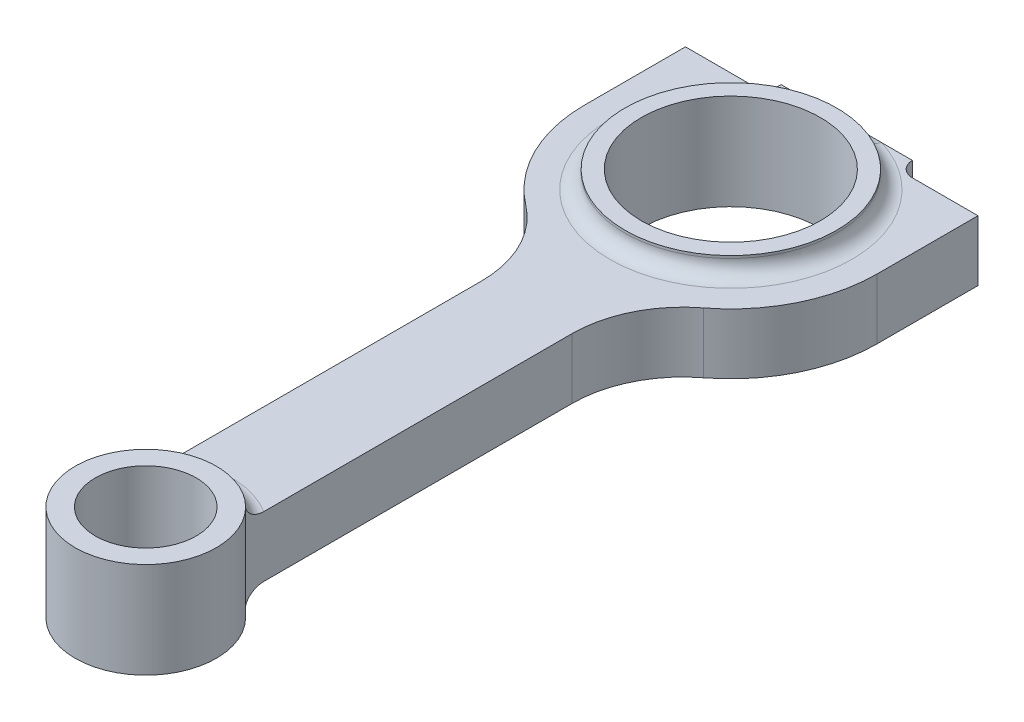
ISO-10303-21;
HEADER;
FILE_DESCRIPTION(('STEP AP214'),'2;1');
FILE_NAME('part.step','',(''),(''),'','','');
FILE_SCHEMA(('AUTOMOTIVE_DESIGN { 1 0 10303 214 1 1 1 1 }'));
ENDSEC;
DATA;
#1=APPLICATION_CONTEXT('core data for automotive mechanical design processes');
#2=APPLICATION_PROTOCOL_DEFINITION('international standard','automotive_design',2000,#1);
#3=PRODUCT_CONTEXT('',#1,'mechanical');
#4=PRODUCT('Part','Part','',(#3));
#5=PRODUCT_RELATED_PRODUCT_CATEGORY('part','',(#4));
#6=PRODUCT_DEFINITION_FORMATION('','',#4);
#7=PRODUCT_DEFINITION_CONTEXT('part definition',#1,'design');
#8=PRODUCT_DEFINITION('design','',#6,#7);
#9=PRODUCT_DEFINITION_SHAPE('','',#8);
#10=(LENGTH_UNIT() NAMED_UNIT(*) SI_UNIT(.MILLI.,.METRE.));
#11=(NAMED_UNIT(*) PLANE_ANGLE_UNIT() SI_UNIT($,.RADIAN.));
#12=(NAMED_UNIT(*) SI_UNIT($,.STERADIAN.) SOLID_ANGLE_UNIT());
#13=UNCERTAINTY_MEASURE_WITH_UNIT(LENGTH_MEASURE(1.E-05),#10,'distance_accuracy_value','');
#14=(GEOMETRIC_REPRESENTATION_CONTEXT(3) GLOBAL_UNCERTAINTY_ASSIGNED_CONTEXT((#13)) GLOBAL_UNIT_ASSIGNED_CONTEXT((#10,
#11,#12)) REPRESENTATION_CONTEXT('',''));
#15=CARTESIAN_POINT('',(0.,0.,0.));
#16=DIRECTION('',(0.,0.,1.));
#17=DIRECTION('',(1.,0.,0.));
#18=AXIS2_PLACEMENT_3D('',#15,#16,#17);
#19=CARTESIAN_POINT('',(0.,6.,0.));
#20=DIRECTION('',(0.,1.,0.));
#21=DIRECTION('',(0.,0.,1.));
#22=AXIS2_PLACEMENT_3D('',#19,#20,#21);
#23=PLANE('',#22);
#24=DIRECTION('',(-1.,0.,0.));
#25=VECTOR('',#24,1.);
#26=CARTESIAN_POINT('',(13.,6.,-23.));
#27=LINE('',#26,#25);
#28=CARTESIAN_POINT('',(13.,6.,-23.));
#29=VERTEX_POINT('',#28);
#30=CARTESIAN_POINT('',(6.85565460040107,6.,-23.));
#31=VERTEX_POINT('',#30);
#32=EDGE_CURVE('E226',#29,#31,#27,.T.);
#33=ORIENTED_EDGE('',*,*,#32,.T.);
#34=CARTESIAN_POINT('',(0.,6.,0.));
#35=DIRECTION('',(0.,1.,0.));
#36=DIRECTION('',(0.,0.,1.));
#37=AXIS2_PLACEMENT_3D('',#34,#35,#36);
#38=CIRCLE('',#37,24.);
#39=CARTESIAN_POINT('',(-6.85565460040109,6.,-23.));
#40=VERTEX_POINT('',#39);
#41=EDGE_CURVE('E11',#31,#40,#38,.F.);
#42=ORIENTED_EDGE('',*,*,#41,.T.);
#43=CARTESIAN_POINT('',(-13.,6.,-23.));
#44=VERTEX_POINT('',#43);
#45=EDGE_CURVE('E225',#40,#44,#27,.T.);
#46=ORIENTED_EDGE('',*,*,#45,.T.);
#47=CARTESIAN_POINT('',(-16.,6.,-23.));
#48=DIRECTION('',(0.,1.,0.));
#49=DIRECTION('',(0.,0.,1.));
#50=AXIS2_PLACEMENT_3D('',#47,#48,#49);
#51=CIRCLE('',#50,3.);
#52=CARTESIAN_POINT('',(-16.,6.,-20.));
#53=VERTEX_POINT('',#52);
#54=EDGE_CURVE('E185',#44,#53,#51,.F.);
#55=ORIENTED_EDGE('',*,*,#54,.T.);
#56=DIRECTION('',(-1.,0.,0.));
#57=VECTOR('',#56,1.);
#58=CARTESIAN_POINT('',(-29.,6.,-20.));
#59=LINE('',#58,#57);
#60=CARTESIAN_POINT('',(-29.,6.,-20.));
#61=VERTEX_POINT('',#60);
#62=EDGE_CURVE('E178',#53,#61,#59,.T.);
#63=ORIENTED_EDGE('',*,*,#62,.T.);
#64=DIRECTION('',(0.,0.,1.));
#65=VECTOR('',#64,1.);
#66=CARTESIAN_POINT('',(-29.,6.,0.));
#67=LINE('',#66,#65);
#68=CARTESIAN_POINT('',(-29.,6.,0.));
#69=VERTEX_POINT('',#68);
#70=EDGE_CURVE('E182',#61,#69,#67,.T.);
#71=ORIENTED_EDGE('',*,*,#70,.T.);
#72=CARTESIAN_POINT('',(0.,6.,0.));
#73=DIRECTION('',(0.,1.,0.));
#74=DIRECTION('',(0.,0.,-1.));
#75=AXIS2_PLACEMENT_3D('',#72,#73,#74);
#76=CIRCLE('',#75,29.);
#77=CARTESIAN_POINT('',(-17.6274509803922,6.,23.0276566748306));
#78=VERTEX_POINT('',#77);
#79=EDGE_CURVE('E204',#69,#78,#76,.T.);
#80=ORIENTED_EDGE('',*,*,#79,.T.);
#81=CARTESIAN_POINT('',(-31.,6.,40.4969134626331));
#82=DIRECTION('',(0.,-1.,0.));
#83=DIRECTION('',(0.,0.,-1.));
#84=AXIS2_PLACEMENT_3D('',#81,#82,#83);
#85=CIRCLE('',#84,22.);
#86=CARTESIAN_POINT('',(-9.00000000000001,6.,40.4969134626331));
#87=VERTEX_POINT('',#86);
#88=EDGE_CURVE('E206',#78,#87,#85,.T.);
#89=ORIENTED_EDGE('',*,*,#88,.T.);
#90=DIRECTION('',(0.,0.,1.));
#91=VECTOR('',#90,1.);
#92=CARTESIAN_POINT('',(-9.00000000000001,6.,105.276194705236));
#93=LINE('',#92,#91);
#94=CARTESIAN_POINT('',(-9.00000000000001,6.,101.577794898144));
#95=VERTEX_POINT('',#94);
#96=EDGE_CURVE('E211',#87,#95,#93,.T.);
#97=ORIENTED_EDGE('',*,*,#96,.T.);
#98=CARTESIAN_POINT('',(0.,6.,116.));
#99=DIRECTION('',(0.,1.,0.));
#100=DIRECTION('',(0.,0.,1.));
#101=AXIS2_PLACEMENT_3D('',#98,#99,#100);
#102=CIRCLE('',#101,17.);
#103=CARTESIAN_POINT('',(9.00000000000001,6.,101.577794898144));
#104=VERTEX_POINT('',#103);
#105=EDGE_CURVE('E291',#95,#104,#102,.F.);
#106=ORIENTED_EDGE('',*,*,#105,.T.);
#107=DIRECTION('',(0.,0.,-1.));
#108=VECTOR('',#107,1.);
#109=CARTESIAN_POINT('',(9.00000000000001,6.,105.276194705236));
#110=LINE('',#109,#108);
#111=CARTESIAN_POINT('',(9.00000000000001,6.,40.4969134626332));
#112=VERTEX_POINT('',#111);
#113=EDGE_CURVE('E214',#104,#112,#110,.T.);
#114=ORIENTED_EDGE('',*,*,#113,.T.);
#115=CARTESIAN_POINT('',(31.,6.,40.4969134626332));
#116=DIRECTION('',(0.,-1.,0.));
#117=DIRECTION('',(0.,0.,1.));
#118=AXIS2_PLACEMENT_3D('',#115,#116,#117);
#119=CIRCLE('',#118,22.);
#120=CARTESIAN_POINT('',(17.6274509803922,6.,23.0276566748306));
#121=VERTEX_POINT('',#120);
#122=EDGE_CURVE('E216',#112,#121,#119,.T.);
#123=ORIENTED_EDGE('',*,*,#122,.T.);
#124=CARTESIAN_POINT('',(0.,6.,0.));
#125=DIRECTION('',(0.,1.,0.));
#126=DIRECTION('',(0.,0.,1.));
#127=AXIS2_PLACEMENT_3D('',#124,#125,#126);
#128=CIRCLE('',#127,29.);
#129=CARTESIAN_POINT('',(29.,6.,0.));
#130=VERTEX_POINT('',#129);
#131=EDGE_CURVE('E218',#121,#130,#128,.T.);
#132=ORIENTED_EDGE('',*,*,#131,.T.);
#133=DIRECTION('',(0.,0.,-1.));
#134=VECTOR('',#133,1.);
#135=CARTESIAN_POINT('',(29.,6.,0.));
#136=LINE('',#135,#134);
#137=CARTESIAN_POINT('',(29.,6.,-20.));
#138=VERTEX_POINT('',#137);
#139=EDGE_CURVE('E220',#130,#138,#136,.T.);
#140=ORIENTED_EDGE('',*,*,#139,.T.);
#141=DIRECTION('',(-1.,0.,0.));
#142=VECTOR('',#141,1.);
#143=CARTESIAN_POINT('',(29.,6.,-20.));
#144=LINE('',#143,#142);
#145=CARTESIAN_POINT('',(16.,6.,-20.));
#146=VERTEX_POINT('',#145);
#147=EDGE_CURVE('E222',#138,#146,#144,.T.);
#148=ORIENTED_EDGE('',*,*,#147,.T.);
#149=CARTESIAN_POINT('',(16.,6.,-23.));
#150=DIRECTION('',(0.,1.,0.));
#151=DIRECTION('',(0.,0.,1.));
#152=AXIS2_PLACEMENT_3D('',#149,#150,#151);
#153=CIRCLE('',#152,3.);
#154=EDGE_CURVE('E384',#146,#29,#153,.F.);
#155=ORIENTED_EDGE('',*,*,#154,.T.);
#156=EDGE_LOOP('',(#33,#42,#46,#55,#63,#71,#80,#89,#97,#106,#114,#123,#132,#140,#148,#155));
#157=FACE_BOUND('',#156,.T.);
#158=ADVANCED_FACE('F35',(#157),#23,.T.);
#159=CARTESIAN_POINT('',(0.,-6.,0.));
#160=DIRECTION('',(0.,1.,0.));
#161=DIRECTION('',(0.,0.,1.));
#162=AXIS2_PLACEMENT_3D('',#159,#160,#161);
#163=PLANE('',#162);
#164=DIRECTION('',(-1.,0.,0.));
#165=VECTOR('',#164,1.);
#166=CARTESIAN_POINT('',(13.,-6.,-23.));
#167=LINE('',#166,#165);
#168=CARTESIAN_POINT('',(-6.85565460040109,-6.,-23.));
#169=VERTEX_POINT('',#168);
#170=CARTESIAN_POINT('',(-13.,-6.,-23.));
#171=VERTEX_POINT('',#170);
#172=EDGE_CURVE('E252',#169,#171,#167,.T.);
#173=ORIENTED_EDGE('',*,*,#172,.F.);
#174=CARTESIAN_POINT('',(0.,-6.,0.));
#175=DIRECTION('',(0.,1.,0.));
#176=DIRECTION('',(0.,0.,1.));
#177=AXIS2_PLACEMENT_3D('',#174,#175,#176);
#178=CIRCLE('',#177,24.);
#179=CARTESIAN_POINT('',(6.85565460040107,-6.,-23.));
#180=VERTEX_POINT('',#179);
#181=EDGE_CURVE('E49',#169,#180,#178,.T.);
#182=ORIENTED_EDGE('',*,*,#181,.T.);
#183=CARTESIAN_POINT('',(13.,-6.,-23.));
#184=VERTEX_POINT('',#183);
#185=EDGE_CURVE('E189',#184,#180,#167,.T.);
#186=ORIENTED_EDGE('',*,*,#185,.F.);
#187=CARTESIAN_POINT('',(16.,-6.,-23.));
#188=DIRECTION('',(0.,1.,0.));
#189=DIRECTION('',(0.,0.,1.));
#190=AXIS2_PLACEMENT_3D('',#187,#188,#189);
#191=CIRCLE('',#190,3.);
#192=CARTESIAN_POINT('',(16.,-6.,-20.));
#193=VERTEX_POINT('',#192);
#194=EDGE_CURVE('E389',#184,#193,#191,.T.);
#195=ORIENTED_EDGE('',*,*,#194,.T.);
#196=DIRECTION('',(-1.,0.,0.));
#197=VECTOR('',#196,1.);
#198=CARTESIAN_POINT('',(29.,-6.,-20.));
#199=LINE('',#198,#197);
#200=CARTESIAN_POINT('',(29.,-6.,-20.));
#201=VERTEX_POINT('',#200);
#202=EDGE_CURVE('E249',#201,#193,#199,.T.);
#203=ORIENTED_EDGE('',*,*,#202,.F.);
#204=DIRECTION('',(0.,0.,-1.));
#205=VECTOR('',#204,1.);
#206=CARTESIAN_POINT('',(29.,-6.,0.));
#207=LINE('',#206,#205);
#208=CARTESIAN_POINT('',(29.,-6.,0.));
#209=VERTEX_POINT('',#208);
#210=EDGE_CURVE('E247',#209,#201,#207,.T.);
#211=ORIENTED_EDGE('',*,*,#210,.F.);
#212=CARTESIAN_POINT('',(0.,-6.,0.));
#213=DIRECTION('',(0.,1.,0.));
#214=DIRECTION('',(0.,0.,1.));
#215=AXIS2_PLACEMENT_3D('',#212,#213,#214);
#216=CIRCLE('',#215,29.);
#217=CARTESIAN_POINT('',(17.6274509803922,-6.,23.0276566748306));
#218=VERTEX_POINT('',#217);
#219=EDGE_CURVE('E245',#218,#209,#216,.T.);
#220=ORIENTED_EDGE('',*,*,#219,.F.);
#221=CARTESIAN_POINT('',(31.,-6.,40.4969134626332));
#222=DIRECTION('',(0.,-1.,0.));
#223=DIRECTION('',(0.,0.,1.));
#224=AXIS2_PLACEMENT_3D('',#221,#222,#223);
#225=CIRCLE('',#224,22.);
#226=CARTESIAN_POINT('',(9.00000000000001,-6.,40.4969134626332));
#227=VERTEX_POINT('',#226);
#228=EDGE_CURVE('E243',#227,#218,#225,.T.);
#229=ORIENTED_EDGE('',*,*,#228,.F.);
#230=DIRECTION('',(0.,0.,-1.));
#231=VECTOR('',#230,1.);
#232=CARTESIAN_POINT('',(9.00000000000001,-6.,105.276194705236));
#233=LINE('',#232,#231);
#234=CARTESIAN_POINT('',(9.00000000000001,-6.,101.577794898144));
#235=VERTEX_POINT('',#234);
#236=EDGE_CURVE('E241',#235,#227,#233,.T.);
#237=ORIENTED_EDGE('',*,*,#236,.F.);
#238=CARTESIAN_POINT('',(0.,-6.,116.));
#239=DIRECTION('',(0.,1.,0.));
#240=DIRECTION('',(0.,0.,1.));
#241=AXIS2_PLACEMENT_3D('',#238,#239,#240);
#242=CIRCLE('',#241,17.);
#243=CARTESIAN_POINT('',(-9.00000000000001,-6.,101.577794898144));
#244=VERTEX_POINT('',#243);
#245=EDGE_CURVE('E289',#235,#244,#242,.T.);
#246=ORIENTED_EDGE('',*,*,#245,.T.);
#247=DIRECTION('',(0.,0.,1.));
#248=VECTOR('',#247,1.);
#249=CARTESIAN_POINT('',(-9.00000000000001,-6.,105.276194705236));
#250=LINE('',#249,#248);
#251=CARTESIAN_POINT('',(-9.00000000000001,-6.,40.4969134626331));
#252=VERTEX_POINT('',#251);
#253=EDGE_CURVE('E238',#252,#244,#250,.T.);
#254=ORIENTED_EDGE('',*,*,#253,.F.);
#255=CARTESIAN_POINT('',(-31.,-6.,40.4969134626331));
#256=DIRECTION('',(0.,-1.,0.));
#257=DIRECTION('',(0.,0.,-1.));
#258=AXIS2_PLACEMENT_3D('',#255,#256,#257);
#259=CIRCLE('',#258,22.);
#260=CARTESIAN_POINT('',(-17.6274509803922,-6.,23.0276566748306));
#261=VERTEX_POINT('',#260);
#262=EDGE_CURVE('E236',#261,#252,#259,.T.);
#263=ORIENTED_EDGE('',*,*,#262,.F.);
#264=CARTESIAN_POINT('',(0.,-6.,0.));
#265=DIRECTION('',(0.,1.,0.));
#266=DIRECTION('',(0.,0.,-1.));
#267=AXIS2_PLACEMENT_3D('',#264,#265,#266);
#268=CIRCLE('',#267,29.);
#269=CARTESIAN_POINT('',(-29.,-6.,0.));
#270=VERTEX_POINT('',#269);
#271=EDGE_CURVE('E234',#270,#261,#268,.T.);
#272=ORIENTED_EDGE('',*,*,#271,.F.);
#273=DIRECTION('',(0.,0.,1.));
#274=VECTOR('',#273,1.);
#275=CARTESIAN_POINT('',(-29.,-6.,0.));
#276=LINE('',#275,#274);
#277=CARTESIAN_POINT('',(-29.,-6.,-20.));
#278=VERTEX_POINT('',#277);
#279=EDGE_CURVE('E231',#278,#270,#276,.T.);
#280=ORIENTED_EDGE('',*,*,#279,.F.);
#281=DIRECTION('',(-1.,0.,0.));
#282=VECTOR('',#281,1.);
#283=CARTESIAN_POINT('',(-29.,-6.,-20.));
#284=LINE('',#283,#282);
#285=CARTESIAN_POINT('',(-16.,-6.,-20.));
#286=VERTEX_POINT('',#285);
#287=EDGE_CURVE('E195',#286,#278,#284,.T.);
#288=ORIENTED_EDGE('',*,*,#287,.F.);
#289=CARTESIAN_POINT('',(-16.,-6.,-23.));
#290=DIRECTION('',(0.,1.,0.));
#291=DIRECTION('',(0.,0.,1.));
#292=AXIS2_PLACEMENT_3D('',#289,#290,#291);
#293=CIRCLE('',#292,3.);
#294=EDGE_CURVE('E388',#286,#171,#293,.T.);
#295=ORIENTED_EDGE('',*,*,#294,.T.);
#296=EDGE_LOOP('',(#173,#182,#186,#195,#203,#211,#220,#229,#237,#246,#254,#263,#272,#280,#288,#295));
#297=FACE_BOUND('',#296,.T.);
#298=ADVANCED_FACE('F452',(#297),#163,.F.);
#299=CARTESIAN_POINT('',(-29.,6.,-20.));
#300=DIRECTION('',(0.,0.,1.));
#301=DIRECTION('',(1.,0.,0.));
#302=AXIS2_PLACEMENT_3D('',#299,#300,#301);
#303=PLANE('',#302);
#304=ORIENTED_EDGE('',*,*,#62,.F.);
#305=DIRECTION('',(0.,-1.,0.));
#306=VECTOR('',#305,1.);
#307=CARTESIAN_POINT('',(-16.,-6.,-20.));
#308=LINE('',#307,#306);
#309=EDGE_CURVE('E296',#53,#286,#308,.T.);
#310=ORIENTED_EDGE('',*,*,#309,.T.);
#311=ORIENTED_EDGE('',*,*,#287,.T.);
#312=DIRECTION('',(0.,-1.,0.));
#313=VECTOR('',#312,1.);
#314=CARTESIAN_POINT('',(-29.,6.,-20.));
#315=LINE('',#314,#313);
#316=EDGE_CURVE('E192',#61,#278,#315,.T.);
#317=ORIENTED_EDGE('',*,*,#316,.F.);
#318=EDGE_LOOP('',(#304,#310,#311,#317));
#319=FACE_BOUND('',#318,.T.);
#320=ADVANCED_FACE('F193',(#319),#303,.F.);
#321=CARTESIAN_POINT('',(-29.,6.,0.));
#322=DIRECTION('',(1.,0.,0.));
#323=DIRECTION('',(0.,0.,-1.));
#324=AXIS2_PLACEMENT_3D('',#321,#322,#323);
#325=PLANE('',#324);
#326=ORIENTED_EDGE('',*,*,#279,.T.);
#327=DIRECTION('',(0.,-1.,0.));
#328=VECTOR('',#327,1.);
#329=CARTESIAN_POINT('',(-29.,6.,0.));
#330=LINE('',#329,#328);
#331=EDGE_CURVE('E199',#69,#270,#330,.T.);
#332=ORIENTED_EDGE('',*,*,#331,.F.);
#333=ORIENTED_EDGE('',*,*,#70,.F.);
#334=ORIENTED_EDGE('',*,*,#316,.T.);
#335=EDGE_LOOP('',(#326,#332,#333,#334));
#336=FACE_BOUND('',#335,.T.);
#337=ADVANCED_FACE('F201',(#336),#325,.F.);
#338=CARTESIAN_POINT('',(0.,6.,0.));
#339=DIRECTION('',(0.,-1.,0.));
#340=DIRECTION('',(0.,0.,-1.));
#341=AXIS2_PLACEMENT_3D('',#338,#339,#340);
#342=CYLINDRICAL_SURFACE('',#341,29.);
#343=ORIENTED_EDGE('',*,*,#271,.T.);
#344=DIRECTION('',(0.,-1.,0.));
#345=VECTOR('',#344,1.);
#346=CARTESIAN_POINT('',(-17.6274509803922,6.,23.0276566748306));
#347=LINE('',#346,#345);
#348=EDGE_CURVE('E280',#78,#261,#347,.T.);
#349=ORIENTED_EDGE('',*,*,#348,.F.);
#350=ORIENTED_EDGE('',*,*,#79,.F.);
#351=ORIENTED_EDGE('',*,*,#331,.T.);
#352=EDGE_LOOP('',(#343,#349,#350,#351));
#353=FACE_BOUND('',#352,.T.);
#354=ADVANCED_FACE('F539',(#353),#342,.T.);
#355=CARTESIAN_POINT('',(-31.,6.,40.4969134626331));
#356=DIRECTION('',(0.,-1.,0.));
#357=DIRECTION('',(0.,0.,-1.));
#358=AXIS2_PLACEMENT_3D('',#355,#356,#357);
#359=CYLINDRICAL_SURFACE('',#358,22.);
#360=ORIENTED_EDGE('',*,*,#262,.T.);
#361=DIRECTION('',(0.,-1.,0.));
#362=VECTOR('',#361,1.);
#363=CARTESIAN_POINT('',(-9.00000000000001,6.,40.4969134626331));
#364=LINE('',#363,#362);
#365=EDGE_CURVE('E277',#87,#252,#364,.T.);
#366=ORIENTED_EDGE('',*,*,#365,.F.);
#367=ORIENTED_EDGE('',*,*,#88,.F.);
#368=ORIENTED_EDGE('',*,*,#348,.T.);
#369=EDGE_LOOP('',(#360,#366,#367,#368));
#370=FACE_BOUND('',#369,.T.);
#371=ADVANCED_FACE('F534',(#370),#359,.F.);
#372=CARTESIAN_POINT('',(-9.00000000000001,6.,105.276194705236));
#373=DIRECTION('',(1.,0.,0.));
#374=DIRECTION('',(0.,0.,-1.));
#375=AXIS2_PLACEMENT_3D('',#372,#373,#374);
#376=PLANE('',#375);
#377=ORIENTED_EDGE('',*,*,#253,.T.);
#378=CARTESIAN_POINT('',(-9.00000000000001,-6.,101.577794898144));
#379=CARTESIAN_POINT('',(-9.00000000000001,-6.00002067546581,101.705268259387));
#380=CARTESIAN_POINT('',(-9.00000000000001,-6.00585028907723,101.832627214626));
#381=CARTESIAN_POINT('',(-9.00000000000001,-6.02893572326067,102.086314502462));
#382=CARTESIAN_POINT('',(-9.00000000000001,-6.04619220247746,102.212642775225));
#383=CARTESIAN_POINT('',(-9.00000000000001,-6.11501822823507,102.589979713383));
#384=CARTESIAN_POINT('',(-9.00000000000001,-6.18364118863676,102.838184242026));
#385=CARTESIAN_POINT('',(-9.00000000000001,-6.31632351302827,103.190125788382));
#386=CARTESIAN_POINT('',(-9.00000000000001,-6.36344388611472,103.30056792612));
#387=CARTESIAN_POINT('',(-9.00000000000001,-6.46714607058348,103.516909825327));
#388=CARTESIAN_POINT('',(-9.00000000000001,-6.52372755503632,103.622809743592));
#389=CARTESIAN_POINT('',(-9.00000000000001,-6.70731723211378,103.931671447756));
#390=CARTESIAN_POINT('',(-9.00000000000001,-6.84848059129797,104.126629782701));
#391=CARTESIAN_POINT('',(-9.00000000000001,-7.12015042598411,104.431117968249));
#392=CARTESIAN_POINT('',(-9.00000000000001,-7.24152293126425,104.548885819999));
#393=CARTESIAN_POINT('',(-9.00000000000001,-7.50167576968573,104.763460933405));
#394=CARTESIAN_POINT('',(-9.00000000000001,-7.6404353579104,104.860292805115));
#395=CARTESIAN_POINT('',(-9.00000000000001,-7.90880977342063,105.013312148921));
#396=CARTESIAN_POINT('',(-9.00000000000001,-8.03609227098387,105.073584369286));
#397=CARTESIAN_POINT('',(-9.00000000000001,-8.29885395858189,105.172046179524));
#398=CARTESIAN_POINT('',(-9.00000000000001,-8.43431588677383,105.21028059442));
#399=CARTESIAN_POINT('',(-9.00000000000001,-8.6425071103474,105.249416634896));
#400=CARTESIAN_POINT('',(-9.00000000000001,-8.71361355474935,105.259431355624));
#401=CARTESIAN_POINT('',(-9.00000000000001,-8.85646553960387,105.272827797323));
#402=CARTESIAN_POINT('',(-9.00000000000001,-8.92821124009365,105.276207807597));
#403=CARTESIAN_POINT('',(-9.00000000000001,-8.99999999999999,105.276194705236));
#404=B_SPLINE_CURVE_WITH_KNOTS('',3,(#378,#379,#380,#381,#382,#383,#384,#385,#386,#387,#388,
#389,#390,#391,#392,#393,#394,#395,#396,#397,#398,#399,#400,#401,#402,#403),.UNSPECIFIED.,.F.,
.F.,(4,2,2,2,2,2,2,2,2,2,2,2,4),(0.,0.382068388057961,0.764158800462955,1.5317615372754,
1.89161823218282,2.25146249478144,2.96851571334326,3.47410726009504,3.97910121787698,
4.39990198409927,4.81984379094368,5.03499352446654,5.25019872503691),.UNSPECIFIED.);
#405=CARTESIAN_POINT('',(-8.99999999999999,-9.,105.276194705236));
#406=VERTEX_POINT('',#405);
#407=EDGE_CURVE('E495',#244,#406,#404,.T.);
#408=ORIENTED_EDGE('',*,*,#407,.T.);
#409=DIRECTION('',(0.,-1.,0.));
#410=VECTOR('',#409,1.);
#411=CARTESIAN_POINT('',(-8.99999999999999,6.,105.276194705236));
#412=LINE('',#411,#410);
#413=CARTESIAN_POINT('',(-8.99999999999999,9.,105.276194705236));
#414=VERTEX_POINT('',#413);
#415=EDGE_CURVE('E275',#414,#406,#412,.T.);
#416=ORIENTED_EDGE('',*,*,#415,.F.);
#417=CARTESIAN_POINT('',(-8.99999999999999,9.,105.276194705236));
#418=CARTESIAN_POINT('',(-9.00000000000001,8.92852774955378,105.276218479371));
#419=CARTESIAN_POINT('',(-9.00000000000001,8.85706836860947,105.272861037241));
#420=CARTESIAN_POINT('',(-9.00000000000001,8.71481425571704,105.259566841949));
#421=CARTESIAN_POINT('',(-9.00000000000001,8.64401908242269,105.249634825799));
#422=CARTESIAN_POINT('',(-9.00000000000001,8.50417398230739,105.223476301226));
#423=CARTESIAN_POINT('',(-9.00000000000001,8.43511476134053,105.207299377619));
#424=CARTESIAN_POINT('',(-9.00000000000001,8.2986849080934,105.168978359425));
#425=CARTESIAN_POINT('',(-9.00000000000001,8.23131450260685,105.146833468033));
#426=CARTESIAN_POINT('',(-9.00000000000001,8.03276496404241,105.072140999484));
#427=CARTESIAN_POINT('',(-9.00000000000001,7.90464673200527,105.011238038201));
#428=CARTESIAN_POINT('',(-9.00000000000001,7.65907517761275,104.870608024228));
#429=CARTESIAN_POINT('',(-9.00000000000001,7.54164668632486,104.790838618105));
#430=CARTESIAN_POINT('',(-9.00000000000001,7.27970309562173,104.585186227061));
#431=CARTESIAN_POINT('',(-9.00000000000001,7.14016548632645,104.452948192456));
#432=CARTESIAN_POINT('',(-9.00000000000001,6.88450468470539,104.167587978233));
#433=CARTESIAN_POINT('',(-9.00000000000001,6.76840904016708,104.0144415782));
#434=CARTESIAN_POINT('',(-9.00000000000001,6.55863896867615,103.690513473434));
#435=CARTESIAN_POINT('',(-9.00000000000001,6.46530325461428,103.519513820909));
#436=CARTESIAN_POINT('',(-9.00000000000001,6.30357318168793,103.16624472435));
#437=CARTESIAN_POINT('',(-9.00000000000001,6.23517175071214,102.983978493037));
#438=CARTESIAN_POINT('',(-9.00000000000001,6.12029197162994,102.600281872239));
#439=CARTESIAN_POINT('',(-9.00000000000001,6.07543702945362,102.398364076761));
#440=CARTESIAN_POINT('',(-9.00000000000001,6.01531087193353,101.990245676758));
#441=CARTESIAN_POINT('',(-9.00000000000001,6.00003005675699,101.78404648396));
#442=CARTESIAN_POINT('',(-9.00000000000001,6.,101.577794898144));
#443=B_SPLINE_CURVE_WITH_KNOTS('',3,(#417,#418,#419,#420,#421,#422,#423,#424,#425,#426,#427,
#428,#429,#430,#431,#432,#433,#434,#435,#436,#437,#438,#439,#440,#441,#442),.UNSPECIFIED.,.F.,
.F.,(4,2,2,2,2,2,2,2,2,2,2,2,4),(0.,0.214316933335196,0.428479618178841,0.640975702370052,
0.853500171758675,1.27703850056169,1.70153681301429,2.27516878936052,2.8494709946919,
3.43185952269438,4.01408273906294,4.63242753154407,5.25057157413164),.UNSPECIFIED.);
#444=EDGE_CURVE('E392',#414,#95,#443,.T.);
#445=ORIENTED_EDGE('',*,*,#444,.T.);
#446=ORIENTED_EDGE('',*,*,#96,.F.);
#447=ORIENTED_EDGE('',*,*,#365,.T.);
#448=EDGE_LOOP('',(#377,#408,#416,#445,#446,#447));
#449=FACE_BOUND('',#448,.T.);
#450=ADVANCED_FACE('F530',(#449),#376,.F.);
#451=CARTESIAN_POINT('',(0.,6.,116.));
#452=DIRECTION('',(0.,-1.,0.));
#453=DIRECTION('',(0.,0.,-1.));
#454=AXIS2_PLACEMENT_3D('',#451,#452,#453);
#455=CYLINDRICAL_SURFACE('',#454,14.);
#456=CARTESIAN_POINT('',(0.,-9.,116.));
#457=DIRECTION('',(0.,1.,0.));
#458=DIRECTION('',(0.,0.,1.));
#459=AXIS2_PLACEMENT_3D('',#456,#457,#458);
#460=CIRCLE('',#459,14.);
#461=CARTESIAN_POINT('',(9.00000000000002,-9.,105.276194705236));
#462=VERTEX_POINT('',#461);
#463=EDGE_CURVE('E286',#406,#462,#460,.F.);
#464=ORIENTED_EDGE('',*,*,#463,.T.);
#465=DIRECTION('',(0.,-1.,0.));
#466=VECTOR('',#465,1.);
#467=CARTESIAN_POINT('',(9.00000000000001,6.,105.276194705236));
#468=LINE('',#467,#466);
#469=CARTESIAN_POINT('',(9.00000000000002,9.,105.276194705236));
#470=VERTEX_POINT('',#469);
#471=EDGE_CURVE('E273',#470,#462,#468,.T.);
#472=ORIENTED_EDGE('',*,*,#471,.F.);
#473=CARTESIAN_POINT('',(0.,9.,116.));
#474=DIRECTION('',(0.,1.,0.));
#475=DIRECTION('',(0.,0.,1.));
#476=AXIS2_PLACEMENT_3D('',#473,#474,#475);
#477=CIRCLE('',#476,14.);
#478=EDGE_CURVE('E198',#470,#414,#477,.T.);
#479=ORIENTED_EDGE('',*,*,#478,.T.);
#480=ORIENTED_EDGE('',*,*,#415,.T.);
#481=EDGE_LOOP('',(#464,#472,#479,#480));
#482=FACE_BOUND('',#481,.T.);
#483=CARTESIAN_POINT('',(0.,-9.5,116.));
#484=DIRECTION('',(0.,1.,0.));
#485=DIRECTION('',(0.,0.,1.));
#486=AXIS2_PLACEMENT_3D('',#483,#484,#485);
#487=CIRCLE('',#486,14.);
#488=CARTESIAN_POINT('',(0.,-9.5,130.));
#489=VERTEX_POINT('',#488);
#490=EDGE_CURVE('E420',#489,#489,#487,.T.);
#491=ORIENTED_EDGE('',*,*,#490,.T.);
#492=EDGE_LOOP('',(#491));
#493=FACE_BOUND('',#492,.T.);
#494=CARTESIAN_POINT('',(0.,9.5,116.));
#495=DIRECTION('',(0.,1.,0.));
#496=DIRECTION('',(0.,0.,1.));
#497=AXIS2_PLACEMENT_3D('',#494,#495,#496);
#498=CIRCLE('',#497,14.);
#499=CARTESIAN_POINT('',(0.,9.5,130.));
#500=VERTEX_POINT('',#499);
#501=EDGE_CURVE('E232',#500,#500,#498,.T.);
#502=ORIENTED_EDGE('',*,*,#501,.F.);
#503=EDGE_LOOP('',(#502));
#504=FACE_BOUND('',#503,.T.);
#505=ADVANCED_FACE('F427',(#482,#493,#504),#455,.T.);
#506=CARTESIAN_POINT('',(9.00000000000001,6.,105.276194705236));
#507=DIRECTION('',(-1.,0.,0.));
#508=DIRECTION('',(0.,0.,1.));
#509=AXIS2_PLACEMENT_3D('',#506,#507,#508);
#510=PLANE('',#509);
#511=ORIENTED_EDGE('',*,*,#471,.T.);
#512=CARTESIAN_POINT('',(9.00000000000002,-9.,105.276194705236));
#513=CARTESIAN_POINT('',(9.00000000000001,-8.92852774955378,105.276218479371));
#514=CARTESIAN_POINT('',(9.00000000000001,-8.85706836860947,105.272861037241));
#515=CARTESIAN_POINT('',(9.00000000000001,-8.71481425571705,105.259566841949));
#516=CARTESIAN_POINT('',(9.00000000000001,-8.64401908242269,105.249634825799));
#517=CARTESIAN_POINT('',(9.00000000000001,-8.50417398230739,105.223476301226));
#518=CARTESIAN_POINT('',(9.00000000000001,-8.43511476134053,105.207299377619));
#519=CARTESIAN_POINT('',(9.00000000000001,-8.2986849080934,105.168978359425));
#520=CARTESIAN_POINT('',(9.00000000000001,-8.23131450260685,105.146833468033));
#521=CARTESIAN_POINT('',(9.00000000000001,-8.03276496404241,105.072140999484));
#522=CARTESIAN_POINT('',(9.00000000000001,-7.90464673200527,105.011238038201));
#523=CARTESIAN_POINT('',(9.00000000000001,-7.65907517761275,104.870608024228));
#524=CARTESIAN_POINT('',(9.00000000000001,-7.54164668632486,104.790838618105));
#525=CARTESIAN_POINT('',(9.00000000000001,-7.27970309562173,104.585186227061));
#526=CARTESIAN_POINT('',(9.00000000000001,-7.14016548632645,104.452948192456));
#527=CARTESIAN_POINT('',(9.00000000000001,-6.88450468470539,104.167587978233));
#528=CARTESIAN_POINT('',(9.00000000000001,-6.76840904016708,104.0144415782));
#529=CARTESIAN_POINT('',(9.00000000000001,-6.55863896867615,103.690513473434));
#530=CARTESIAN_POINT('',(9.00000000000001,-6.46530325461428,103.519513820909));
#531=CARTESIAN_POINT('',(9.00000000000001,-6.30357318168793,103.16624472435));
#532=CARTESIAN_POINT('',(9.00000000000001,-6.23517175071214,102.983978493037));
#533=CARTESIAN_POINT('',(9.00000000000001,-6.12029197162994,102.600281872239));
#534=CARTESIAN_POINT('',(9.00000000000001,-6.07543702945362,102.398364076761));
#535=CARTESIAN_POINT('',(9.00000000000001,-6.01531087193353,101.990245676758));
#536=CARTESIAN_POINT('',(9.00000000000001,-6.00003005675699,101.78404648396));
#537=CARTESIAN_POINT('',(9.00000000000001,-6.,101.577794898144));
#538=B_SPLINE_CURVE_WITH_KNOTS('',3,(#512,#513,#514,#515,#516,#517,#518,#519,#520,#521,#522,
#523,#524,#525,#526,#527,#528,#529,#530,#531,#532,#533,#534,#535,#536,#537),.UNSPECIFIED.,.F.,
.F.,(4,2,2,2,2,2,2,2,2,2,2,2,4),(0.,0.214316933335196,0.428479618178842,0.640975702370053,
0.853500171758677,1.27703850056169,1.70153681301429,2.27516878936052,2.8494709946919,
3.43185952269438,4.01408273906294,4.63242753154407,5.25057157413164),.UNSPECIFIED.);
#539=EDGE_CURVE('E494',#462,#235,#538,.T.);
#540=ORIENTED_EDGE('',*,*,#539,.T.);
#541=ORIENTED_EDGE('',*,*,#236,.T.);
#542=DIRECTION('',(0.,-1.,0.));
#543=VECTOR('',#542,1.);
#544=CARTESIAN_POINT('',(9.00000000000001,6.,40.4969134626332));
#545=LINE('',#544,#543);
#546=EDGE_CURVE('E270',#112,#227,#545,.T.);
#547=ORIENTED_EDGE('',*,*,#546,.F.);
#548=ORIENTED_EDGE('',*,*,#113,.F.);
#549=CARTESIAN_POINT('',(9.00000000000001,6.,101.577794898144));
#550=CARTESIAN_POINT('',(9.00000000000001,6.00002067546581,101.705268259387));
#551=CARTESIAN_POINT('',(9.00000000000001,6.00585028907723,101.832627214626));
#552=CARTESIAN_POINT('',(9.00000000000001,6.02893572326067,102.086314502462));
#553=CARTESIAN_POINT('',(9.00000000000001,6.04619220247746,102.212642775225));
#554=CARTESIAN_POINT('',(9.00000000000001,6.11501822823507,102.589979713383));
#555=CARTESIAN_POINT('',(9.00000000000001,6.18364118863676,102.838184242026));
#556=CARTESIAN_POINT('',(9.00000000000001,6.31632351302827,103.190125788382));
#557=CARTESIAN_POINT('',(9.00000000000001,6.36344388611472,103.30056792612));
#558=CARTESIAN_POINT('',(9.00000000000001,6.46714607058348,103.516909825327));
#559=CARTESIAN_POINT('',(9.00000000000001,6.52372755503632,103.622809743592));
#560=CARTESIAN_POINT('',(9.00000000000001,6.70731723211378,103.931671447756));
#561=CARTESIAN_POINT('',(9.00000000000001,6.84848059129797,104.126629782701));
#562=CARTESIAN_POINT('',(9.00000000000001,7.12015042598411,104.431117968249));
#563=CARTESIAN_POINT('',(9.00000000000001,7.24152293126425,104.548885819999));
#564=CARTESIAN_POINT('',(9.00000000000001,7.50167576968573,104.763460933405));
#565=CARTESIAN_POINT('',(9.00000000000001,7.6404353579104,104.860292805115));
#566=CARTESIAN_POINT('',(9.00000000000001,7.90880977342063,105.013312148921));
#567=CARTESIAN_POINT('',(9.00000000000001,8.03609227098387,105.073584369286));
#568=CARTESIAN_POINT('',(9.00000000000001,8.29885395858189,105.172046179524));
#569=CARTESIAN_POINT('',(9.00000000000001,8.43431588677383,105.21028059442));
#570=CARTESIAN_POINT('',(9.00000000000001,8.6425071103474,105.249416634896));
#571=CARTESIAN_POINT('',(9.00000000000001,8.71361355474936,105.259431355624));
#572=CARTESIAN_POINT('',(9.00000000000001,8.85646553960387,105.272827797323));
#573=CARTESIAN_POINT('',(9.00000000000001,8.92821124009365,105.276207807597));
#574=CARTESIAN_POINT('',(9.00000000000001,9.,105.276194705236));
#575=B_SPLINE_CURVE_WITH_KNOTS('',3,(#549,#550,#551,#552,#553,#554,#555,#556,#557,#558,#559,
#560,#561,#562,#563,#564,#565,#566,#567,#568,#569,#570,#571,#572,#573,#574),.UNSPECIFIED.,.F.,
.F.,(4,2,2,2,2,2,2,2,2,2,2,2,4),(0.,0.382068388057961,0.764158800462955,1.5317615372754,
1.89161823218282,2.25146249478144,2.96851571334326,3.47410726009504,3.97910121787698,
4.39990198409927,4.81984379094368,5.03499352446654,5.25019872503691),.UNSPECIFIED.);
#576=EDGE_CURVE('E521',#104,#470,#575,.T.);
#577=ORIENTED_EDGE('',*,*,#576,.T.);
#578=EDGE_LOOP('',(#511,#540,#541,#547,#548,#577));
#579=FACE_BOUND('',#578,.T.);
#580=ADVANCED_FACE('F509',(#579),#510,.F.);
#581=CARTESIAN_POINT('',(31.,6.,40.4969134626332));
#582=DIRECTION('',(0.,-1.,0.));
#583=DIRECTION('',(0.,0.,-1.));
#584=AXIS2_PLACEMENT_3D('',#581,#582,#583);
#585=CYLINDRICAL_SURFACE('',#584,22.);
#586=ORIENTED_EDGE('',*,*,#228,.T.);
#587=DIRECTION('',(0.,-1.,0.));
#588=VECTOR('',#587,1.);
#589=CARTESIAN_POINT('',(17.6274509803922,6.,23.0276566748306));
#590=LINE('',#589,#588);
#591=EDGE_CURVE('E267',#121,#218,#590,.T.);
#592=ORIENTED_EDGE('',*,*,#591,.F.);
#593=ORIENTED_EDGE('',*,*,#122,.F.);
#594=ORIENTED_EDGE('',*,*,#546,.T.);
#595=EDGE_LOOP('',(#586,#592,#593,#594));
#596=FACE_BOUND('',#595,.T.);
#597=ADVANCED_FACE('F573',(#596),#585,.F.);
#598=CARTESIAN_POINT('',(0.,6.,0.));
#599=DIRECTION('',(0.,-1.,0.));
#600=DIRECTION('',(0.,0.,-1.));
#601=AXIS2_PLACEMENT_3D('',#598,#599,#600);
#602=CYLINDRICAL_SURFACE('',#601,29.);
#603=ORIENTED_EDGE('',*,*,#219,.T.);
#604=DIRECTION('',(0.,-1.,0.));
#605=VECTOR('',#604,1.);
#606=CARTESIAN_POINT('',(29.,6.,0.));
#607=LINE('',#606,#605);
#608=EDGE_CURVE('E264',#130,#209,#607,.T.);
#609=ORIENTED_EDGE('',*,*,#608,.F.);
#610=ORIENTED_EDGE('',*,*,#131,.F.);
#611=ORIENTED_EDGE('',*,*,#591,.T.);
#612=EDGE_LOOP('',(#603,#609,#610,#611));
#613=FACE_BOUND('',#612,.T.);
#614=ADVANCED_FACE('F580',(#613),#602,.T.);
#615=CARTESIAN_POINT('',(29.,6.,0.));
#616=DIRECTION('',(-1.,0.,0.));
#617=DIRECTION('',(0.,0.,1.));
#618=AXIS2_PLACEMENT_3D('',#615,#616,#617);
#619=PLANE('',#618);
#620=ORIENTED_EDGE('',*,*,#210,.T.);
#621=DIRECTION('',(0.,-1.,0.));
#622=VECTOR('',#621,1.);
#623=CARTESIAN_POINT('',(29.,6.,-20.));
#624=LINE('',#623,#622);
#625=EDGE_CURVE('E261',#138,#201,#624,.T.);
#626=ORIENTED_EDGE('',*,*,#625,.F.);
#627=ORIENTED_EDGE('',*,*,#139,.F.);
#628=ORIENTED_EDGE('',*,*,#608,.T.);
#629=EDGE_LOOP('',(#620,#626,#627,#628));
#630=FACE_BOUND('',#629,.T.);
#631=ADVANCED_FACE('F587',(#630),#619,.F.);
#632=CARTESIAN_POINT('',(29.,6.,-20.));
#633=DIRECTION('',(0.,0.,1.));
#634=DIRECTION('',(1.,0.,0.));
#635=AXIS2_PLACEMENT_3D('',#632,#633,#634);
#636=PLANE('',#635);
#637=ORIENTED_EDGE('',*,*,#202,.T.);
#638=DIRECTION('',(0.,-1.,0.));
#639=VECTOR('',#638,1.);
#640=CARTESIAN_POINT('',(16.,6.,-20.));
#641=LINE('',#640,#639);
#642=EDGE_CURVE('E294',#193,#146,#641,.F.);
#643=ORIENTED_EDGE('',*,*,#642,.T.);
#644=ORIENTED_EDGE('',*,*,#147,.F.);
#645=ORIENTED_EDGE('',*,*,#625,.T.);
#646=EDGE_LOOP('',(#637,#643,#644,#645));
#647=FACE_BOUND('',#646,.T.);
#648=ADVANCED_FACE('F595',(#647),#636,.F.);
#649=CARTESIAN_POINT('',(13.,6.,-23.));
#650=DIRECTION('',(0.,0.,1.));
#651=DIRECTION('',(1.,0.,0.));
#652=AXIS2_PLACEMENT_3D('',#649,#650,#651);
#653=PLANE('',#652);
#654=ORIENTED_EDGE('',*,*,#185,.T.);
#655=EDGE_CURVE('E255',#180,#169,#167,.T.);
#656=ORIENTED_EDGE('',*,*,#655,.T.);
#657=ORIENTED_EDGE('',*,*,#172,.T.);
#658=DIRECTION('',(0.,-1.,0.));
#659=VECTOR('',#658,1.);
#660=CARTESIAN_POINT('',(-13.,6.,-23.));
#661=LINE('',#660,#659);
#662=EDGE_CURVE('E228',#44,#171,#661,.T.);
#663=ORIENTED_EDGE('',*,*,#662,.F.);
#664=ORIENTED_EDGE('',*,*,#45,.F.);
#665=EDGE_CURVE('E229',#31,#40,#27,.T.);
#666=ORIENTED_EDGE('',*,*,#665,.F.);
#667=ORIENTED_EDGE('',*,*,#32,.F.);
#668=DIRECTION('',(0.,-1.,0.));
#669=VECTOR('',#668,1.);
#670=CARTESIAN_POINT('',(13.,6.,-23.));
#671=LINE('',#670,#669);
#672=EDGE_CURVE('E258',#29,#184,#671,.T.);
#673=ORIENTED_EDGE('',*,*,#672,.T.);
#674=EDGE_LOOP('',(#654,#656,#657,#663,#664,#666,#667,#673));
#675=FACE_BOUND('',#674,.T.);
#676=ADVANCED_FACE('F367',(#675),#653,.F.);
#677=CARTESIAN_POINT('',(0.,-9.5,116.));
#678=DIRECTION('',(0.,1.,0.));
#679=DIRECTION('',(0.,0.,1.));
#680=AXIS2_PLACEMENT_3D('',#677,#678,#679);
#681=PLANE('',#680);
#682=ORIENTED_EDGE('',*,*,#490,.F.);
#683=EDGE_LOOP('',(#682));
#684=FACE_BOUND('',#683,.T.);
#685=CARTESIAN_POINT('',(0.,-9.5,116.));
#686=DIRECTION('',(0.,1.,0.));
#687=DIRECTION('',(0.,0.,1.));
#688=AXIS2_PLACEMENT_3D('',#685,#686,#687);
#689=CIRCLE('',#688,10.);
#690=CARTESIAN_POINT('',(0.,-9.5,126.));
#691=VERTEX_POINT('',#690);
#692=EDGE_CURVE('E414',#691,#691,#689,.T.);
#693=ORIENTED_EDGE('',*,*,#692,.T.);
#694=EDGE_LOOP('',(#693));
#695=FACE_BOUND('',#694,.T.);
#696=ADVANCED_FACE('F430',(#684,#695),#681,.F.);
#697=CARTESIAN_POINT('',(0.,6.,116.));
#698=DIRECTION('',(0.,-1.,0.));
#699=DIRECTION('',(0.,0.,-1.));
#700=AXIS2_PLACEMENT_3D('',#697,#698,#699);
#701=CYLINDRICAL_SURFACE('',#700,9.99999999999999);
#702=ORIENTED_EDGE('',*,*,#692,.F.);
#703=EDGE_LOOP('',(#702));
#704=FACE_BOUND('',#703,.T.);
#705=CARTESIAN_POINT('',(0.,9.5,116.));
#706=DIRECTION('',(0.,1.,0.));
#707=DIRECTION('',(0.,0.,1.));
#708=AXIS2_PLACEMENT_3D('',#705,#706,#707);
#709=CIRCLE('',#708,10.);
#710=CARTESIAN_POINT('',(0.,9.5,126.));
#711=VERTEX_POINT('',#710);
#712=EDGE_CURVE('E417',#711,#711,#709,.T.);
#713=ORIENTED_EDGE('',*,*,#712,.T.);
#714=EDGE_LOOP('',(#713));
#715=FACE_BOUND('',#714,.T.);
#716=ADVANCED_FACE('F433',(#704,#715),#701,.F.);
#717=CARTESIAN_POINT('',(0.,9.5,116.));
#718=DIRECTION('',(0.,1.,0.));
#719=DIRECTION('',(0.,0.,1.));
#720=AXIS2_PLACEMENT_3D('',#717,#718,#719);
#721=PLANE('',#720);
#722=ORIENTED_EDGE('',*,*,#501,.T.);
#723=EDGE_LOOP('',(#722));
#724=FACE_BOUND('',#723,.T.);
#725=ORIENTED_EDGE('',*,*,#712,.F.);
#726=EDGE_LOOP('',(#725));
#727=FACE_BOUND('',#726,.T.);
#728=ADVANCED_FACE('F439',(#724,#727),#721,.T.);
#729=CARTESIAN_POINT('',(0.,9.5,0.));
#730=DIRECTION('',(0.,-1.,0.));
#731=DIRECTION('',(0.,0.,-1.));
#732=AXIS2_PLACEMENT_3D('',#729,#730,#731);
#733=CYLINDRICAL_SURFACE('',#732,21.);
#734=CARTESIAN_POINT('',(0.,-9.,0.));
#735=DIRECTION('',(0.,1.,0.));
#736=DIRECTION('',(0.,0.,1.));
#737=AXIS2_PLACEMENT_3D('',#734,#735,#736);
#738=CIRCLE('',#737,21.);
#739=CARTESIAN_POINT('',(5.99869777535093,-9.,-20.125));
#740=VERTEX_POINT('',#739);
#741=CARTESIAN_POINT('',(-5.99869777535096,-9.,-20.125));
#742=VERTEX_POINT('',#741);
#743=EDGE_CURVE('E298',#740,#742,#738,.F.);
#744=ORIENTED_EDGE('',*,*,#743,.T.);
#745=CARTESIAN_POINT('',(-9.37045559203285,-8.58539855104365,-18.793471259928));
#746=CARTESIAN_POINT('',(-8.98853022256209,-6.96046952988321,-18.9838998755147));
#747=CARTESIAN_POINT('',(-9.42814307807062,-6.11141571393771,-20.3653384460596));
#748=CARTESIAN_POINT('',(-9.86775593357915,-5.2623618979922,-21.7467770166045));
#749=CARTESIAN_POINT('',(-10.7090921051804,-6.,-23.));
#750=CARTESIAN_POINT('',(-9.25512674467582,-8.62404518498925,-18.8509805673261));
#751=CARTESIAN_POINT('',(-8.90200293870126,-7.01112858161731,-19.0241415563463));
#752=CARTESIAN_POINT('',(-9.33343310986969,-6.15438981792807,-20.3789101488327));
#753=CARTESIAN_POINT('',(-9.76542049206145,-5.29740833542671,-21.7335870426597));
#754=CARTESIAN_POINT('',(-10.5772877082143,-6.,-23.));
#755=CARTESIAN_POINT('',(-9.13852945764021,-8.65892273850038,-18.9077847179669));
#756=CARTESIAN_POINT('',(-8.81143094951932,-7.05913180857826,-19.0657002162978));
#757=CARTESIAN_POINT('',(-9.23508190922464,-6.19577470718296,-20.3945721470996));
#758=CARTESIAN_POINT('',(-9.65927918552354,-5.33220610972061,-21.7233480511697));
#759=CARTESIAN_POINT('',(-10.444033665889,-6.,-23.));
#760=CARTESIAN_POINT('',(-8.90324392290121,-8.72203441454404,-19.0197041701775));
#761=CARTESIAN_POINT('',(-8.6238963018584,-7.14964530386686,-19.1502820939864));
#762=CARTESIAN_POINT('',(-9.03226162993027,-6.27515925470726,-20.4291091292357));
#763=CARTESIAN_POINT('',(-9.4411610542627,-5.40046183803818,-21.7078481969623));
#764=CARTESIAN_POINT('',(-10.175135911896,-6.,-23.));
#765=CARTESIAN_POINT('',(-8.78455687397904,-8.75027222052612,-19.0748203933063));
#766=CARTESIAN_POINT('',(-8.5269398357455,-7.1922027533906,-19.1933108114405));
#767=CARTESIAN_POINT('',(-8.92779598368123,-6.31316078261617,-20.4479823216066));
#768=CARTESIAN_POINT('',(-9.32918208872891,-5.43393897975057,-21.7025556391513));
#769=CARTESIAN_POINT('',(-10.039493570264,-6.,-23.));
#770=CARTESIAN_POINT('',(-8.5457089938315,-8.80097631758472,-19.1830139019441));
#771=CARTESIAN_POINT('',(-8.32796365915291,-7.27196312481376,-19.2798648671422));
#772=CARTESIAN_POINT('',(-8.71407237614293,-6.38552900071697,-20.4879410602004));
#773=CARTESIAN_POINT('',(-9.10070851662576,-5.49891666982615,-21.6959177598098));
#774=CARTESIAN_POINT('',(-9.76652456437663,-6.,-23.));
#775=CARTESIAN_POINT('',(-8.42555261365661,-8.82345692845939,-19.2360959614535));
#776=CARTESIAN_POINT('',(-8.22595265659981,-7.3092172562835,-19.3233990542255));
#777=CARTESIAN_POINT('',(-8.60482711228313,-6.41990458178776,-20.5090209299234));
#778=CARTESIAN_POINT('',(-8.98421429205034,-5.53044126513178,-21.6945422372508));
#779=CARTESIAN_POINT('',(-9.6292029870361,-6.,-23.));
#780=CARTESIAN_POINT('',(-8.18372181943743,-8.86348050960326,-19.3402180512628));
#781=CARTESIAN_POINT('',(-8.01745301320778,-7.37885896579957,-19.4104483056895));
#782=CARTESIAN_POINT('',(-8.38207810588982,-6.48518844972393,-20.5527282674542));
#783=CARTESIAN_POINT('',(-8.74721384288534,-5.5913686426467,-21.6949079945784));
#784=CARTESIAN_POINT('',(-9.35282493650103,-6.,-23.));
#785=CARTESIAN_POINT('',(-8.062047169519,-8.8810227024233,-19.3912577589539));
#786=CARTESIAN_POINT('',(-7.91095240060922,-7.41127864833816,-19.4539767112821));
#787=CARTESIAN_POINT('',(-8.2685736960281,-6.51609619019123,-20.5753559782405));
#788=CARTESIAN_POINT('',(-8.62668924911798,-5.62079007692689,-21.6966355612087));
#789=CARTESIAN_POINT('',(-9.21376819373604,-6.,-23.));
#790=CARTESIAN_POINT('',(-7.69645391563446,-8.92706994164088,-19.5405629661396));
#791=CARTESIAN_POINT('',(-7.58767118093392,-7.50126868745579,-19.5829888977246));
#792=CARTESIAN_POINT('',(-7.92397639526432,-6.60346454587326,-20.64439009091));
#793=CARTESIAN_POINT('',(-8.26221843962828,-5.70516606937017,-21.7054045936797));
#794=CARTESIAN_POINT('',(-8.79594733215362,-6.,-23.));
#795=CARTESIAN_POINT('',(-7.45060809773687,-8.94926697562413,-19.635630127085));
#796=CARTESIAN_POINT('',(-7.36451435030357,-7.55255490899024,-19.6680329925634));
#797=CARTESIAN_POINT('',(-7.68757300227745,-6.65497760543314,-20.6921881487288));
#798=CARTESIAN_POINT('',(-8.01240454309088,-5.75706357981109,-21.7159931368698));
#799=CARTESIAN_POINT('',(-8.51498068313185,-6.,-23.));
#800=CARTESIAN_POINT('',(-6.95481662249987,-8.98106817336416,-19.8166668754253));
#801=CARTESIAN_POINT('',(-6.90702357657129,-7.64039821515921,-19.8331578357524));
#802=CARTESIAN_POINT('',(-7.20412851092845,-6.74633413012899,-20.788119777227));
#803=CARTESIAN_POINT('',(-7.50300114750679,-5.85193769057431,-21.7427293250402));
#804=CARTESIAN_POINT('',(-7.94836185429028,-6.,-23.));
#805=CARTESIAN_POINT('',(-6.70486763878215,-8.99066155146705,-19.9026286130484));
#806=CARTESIAN_POINT('',(-6.6725267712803,-7.67709506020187,-19.9133552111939));
#807=CARTESIAN_POINT('',(-6.95707848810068,-6.78616757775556,-20.836253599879));
#808=CARTESIAN_POINT('',(-7.24321314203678,-5.89502031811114,-21.7588549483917));
#809=CARTESIAN_POINT('',(-7.66270587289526,-6.,-23.));
#810=CARTESIAN_POINT('',(-6.1876185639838,-9.00094057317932,-20.0696620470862));
#811=CARTESIAN_POINT('',(-6.18171522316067,-7.74038392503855,-20.071271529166));
#812=CARTESIAN_POINT('',(-6.44078060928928,-6.85788502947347,-20.9332028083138));
#813=CARTESIAN_POINT('',(-6.70160060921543,-5.97514229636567,-21.7948044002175));
#814=CARTESIAN_POINT('',(-7.07156407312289,-6.,-23.));
#815=CARTESIAN_POINT('',(-5.92013427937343,-9.00109392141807,-20.1501854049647));
#816=CARTESIAN_POINT('',(-5.92463244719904,-7.76641904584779,-20.1487552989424));
#817=CARTESIAN_POINT('',(-6.1710663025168,-6.88919474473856,-20.9819038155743));
#818=CARTESIAN_POINT('',(-6.4190321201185,-6.01181932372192,-21.8147911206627));
#819=CARTESIAN_POINT('',(-6.76586774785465,-6.,-23.));
#820=CARTESIAN_POINT('',(-5.38219916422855,-8.99452121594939,-20.3004914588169));
#821=CARTESIAN_POINT('',(-5.40315832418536,-7.80839184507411,-20.2948075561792));
#822=CARTESIAN_POINT('',(-5.62463060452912,-6.94282713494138,-21.075238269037));
#823=CARTESIAN_POINT('',(-5.84762764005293,-6.07711352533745,-21.8554080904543));
#824=CARTESIAN_POINT('',(-6.15108475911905,-6.,-23.));
#825=CARTESIAN_POINT('',(-5.11174778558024,-8.98779386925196,-20.3702721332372));
#826=CARTESIAN_POINT('',(-5.1385604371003,-7.82440361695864,-20.3634928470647));
#827=CARTESIAN_POINT('',(-5.34790790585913,-6.96514811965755,-21.1198709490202));
#828=CARTESIAN_POINT('',(-5.55855597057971,-6.10580482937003,-21.876054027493));
#829=CARTESIAN_POINT('',(-5.84199746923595,-6.,-23.));
#830=CARTESIAN_POINT('',(-4.56826335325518,-8.97031867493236,-20.4989997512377));
#831=CARTESIAN_POINT('',(-4.60355511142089,-7.84905784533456,-20.491067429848));
#832=CARTESIAN_POINT('',(-4.78884027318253,-7.00272511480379,-21.2037733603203));
#833=CARTESIAN_POINT('',(-4.97542096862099,-6.15630568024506,-21.9162846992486));
#834=CARTESIAN_POINT('',(-5.22087240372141,-6.,-23.));
#835=CARTESIAN_POINT('',(-4.2952292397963,-8.95956910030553,-20.5579420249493));
#836=CARTESIAN_POINT('',(-4.33293663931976,-7.8577420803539,-20.5500539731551));
#837=CARTESIAN_POINT('',(-4.50649297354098,-7.01797808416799,-21.2430407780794));
#838=CARTESIAN_POINT('',(-4.68112199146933,-6.17816633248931,-21.9358915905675));
#839=CARTESIAN_POINT('',(-4.90883341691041,-6.,-23.));
#840=CARTESIAN_POINT('',(-3.74707498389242,-8.93652278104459,-20.6648834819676));
#841=CARTESIAN_POINT('',(-3.7872341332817,-7.87010208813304,-20.6575782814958));
#842=CARTESIAN_POINT('',(-3.93743355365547,-7.0431245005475,-21.3152521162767));
#843=CARTESIAN_POINT('',(-4.08870156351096,-6.21610004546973,-21.9727902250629));
#844=CARTESIAN_POINT('',(-4.28237141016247,-6.,-23.));
#845=CARTESIAN_POINT('',(-3.47195480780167,-8.92422601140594,-20.7128824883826));
#846=CARTESIAN_POINT('',(-3.51194084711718,-7.8738016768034,-20.7061995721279));
#847=CARTESIAN_POINT('',(-3.65072136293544,-7.05301786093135,-21.3481959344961));
#848=CARTESIAN_POINT('',(-3.79034911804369,-6.2322104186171,-21.9901058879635));
#849=CARTESIAN_POINT('',(-3.96794835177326,-6.,-23.));
#850=CARTESIAN_POINT('',(-2.91883062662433,-8.90014656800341,-20.7980541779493));
#851=CARTESIAN_POINT('',(-2.95677154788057,-7.87821727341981,-20.7927383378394));
#852=CARTESIAN_POINT('',(-3.07268426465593,-7.06896349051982,-21.4072055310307));
#853=CARTESIAN_POINT('',(-3.18944871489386,-6.2596864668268,-22.0215856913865));
#854=CARTESIAN_POINT('',(-3.33580643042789,-6.,-23.));
#855=CARTESIAN_POINT('',(-2.64081934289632,-8.888366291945,-20.8351801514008));
#856=CARTESIAN_POINT('',(-2.6766656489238,-7.87893121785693,-20.8306769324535));
#857=CARTESIAN_POINT('',(-2.78134496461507,-7.07499931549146,-21.4332415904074));
#858=CARTESIAN_POINT('',(-2.88665292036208,-6.27105711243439,-22.0357584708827));
#859=CARTESIAN_POINT('',(-3.0180792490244,-6.,-23.));
#860=CARTESIAN_POINT('',(-2.08346087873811,-8.86712678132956,-20.8982737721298));
#861=CARTESIAN_POINT('',(-2.11398507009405,-7.8789938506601,-20.8952628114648));
#862=CARTESIAN_POINT('',(-2.19614841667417,-7.08439124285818,-21.4777608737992));
#863=CARTESIAN_POINT('',(-2.27893892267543,-6.28977878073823,-22.0602111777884));
#864=CARTESIAN_POINT('',(-2.38109814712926,-6.,-23.));
#865=CARTESIAN_POINT('',(-1.80411368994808,-8.85766756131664,-20.9242413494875));
#866=CARTESIAN_POINT('',(-1.83119733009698,-7.87834547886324,-20.9219592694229));
#867=CARTESIAN_POINT('',(-1.90229115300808,-7.08774732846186,-21.4962440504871));
#868=CARTESIAN_POINT('',(-1.97378944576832,-6.2971456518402,-22.0705089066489));
#869=CARTESIAN_POINT('',(-2.06184421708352,-6.,-23.));
#870=CARTESIAN_POINT('',(-1.24466437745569,-8.84237505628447,-20.9649571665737));
#871=CARTESIAN_POINT('',(-1.26424478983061,-7.87689744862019,-20.9638425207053));
#872=CARTESIAN_POINT('',(-1.31309343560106,-7.09268356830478,-21.5253210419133));
#873=CARTESIAN_POINT('',(-1.36234550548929,-6.30846644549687,-22.0867796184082));
#874=CARTESIAN_POINT('',(-1.42247357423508,-6.,-23.));
#875=CARTESIAN_POINT('',(-0.964562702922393,-8.83653995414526,-20.9797110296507));
#876=CARTESIAN_POINT('',(-0.979867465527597,-7.87609752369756,-20.9790667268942));
#877=CARTESIAN_POINT('',(-1.01775380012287,-7.09426461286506,-21.535918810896));
#878=CARTESIAN_POINT('',(-1.05582120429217,-6.31243104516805,-22.0927668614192));
#879=CARTESIAN_POINT('',(-1.10235737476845,-6.,-23.));
#880=CARTESIAN_POINT('',(-0.403949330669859,-8.82926095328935,-20.9979875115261));
#881=CARTESIAN_POINT('',(-0.410548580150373,-7.87505997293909,-20.9979176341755));
#882=CARTESIAN_POINT('',(-0.426341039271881,-7.09618737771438,-21.549057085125));
#883=CARTESIAN_POINT('',(-0.442314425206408,-6.31731426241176,-22.1001925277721));
#884=CARTESIAN_POINT('',(-0.46165637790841,-6.,-23.));
#885=CARTESIAN_POINT('',(-0.123437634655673,-8.82781703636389,-21.0015101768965));
#886=CARTESIAN_POINT('',(-0.125393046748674,-7.87482161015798,-21.0015585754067));
#887=CARTESIAN_POINT('',(-0.130267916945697,-7.09652910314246,-21.5515976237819));
#888=CARTESIAN_POINT('',(-0.135101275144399,-6.31823659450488,-22.1016365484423));
#889=CARTESIAN_POINT('',(-0.141071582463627,-6.,-23.));
#890=CARTESIAN_POINT('',(0.446875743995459,-8.82953982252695,-20.9972454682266));
#891=CARTESIAN_POINT('',(0.454061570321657,-7.8750863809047,-20.9971568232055));
#892=CARTESIAN_POINT('',(0.471613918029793,-7.09609757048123,-21.5485269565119));
#893=CARTESIAN_POINT('',(0.489210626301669,-6.31710869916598,-22.0998967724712));
#894=CARTESIAN_POINT('',(0.510715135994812,-6.,-23.));
#895=CARTESIAN_POINT('',(0.736674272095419,-8.83286238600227,-20.9890757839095));
#896=CARTESIAN_POINT('',(0.748578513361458,-7.87561481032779,-20.9887155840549));
#897=CARTESIAN_POINT('',(0.7774169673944,-7.09528662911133,-21.5426401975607));
#898=CARTESIAN_POINT('',(0.806545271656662,-6.31495707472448,-22.0965551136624));
#899=CARTESIAN_POINT('',(0.84191345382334,-6.,-23.));
#900=CARTESIAN_POINT('',(1.31562212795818,-8.84393859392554,-20.9607523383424));
#901=CARTESIAN_POINT('',(1.33613401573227,-7.87703196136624,-20.9595264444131));
#902=CARTESIAN_POINT('',(1.38785287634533,-7.09216265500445,-21.5223214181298));
#903=CARTESIAN_POINT('',(1.4398619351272,-6.30729175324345,-22.0851067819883));
#904=CARTESIAN_POINT('',(1.50356814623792,-6.,-23.));
#905=CARTESIAN_POINT('',(1.60477144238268,-8.85169232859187,-20.9405983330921));
#906=CARTESIAN_POINT('',(1.62940851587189,-7.87792160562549,-20.938754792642));
#907=CARTESIAN_POINT('',(1.69248571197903,-7.08984959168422,-21.5078892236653));
#908=CARTESIAN_POINT('',(1.75609850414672,-6.30177169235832,-22.0769908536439));
#909=CARTESIAN_POINT('',(1.83402450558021,-6.,-23.));
#910=CARTESIAN_POINT('',(2.18212328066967,-8.87052826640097,-20.8883321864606));
#911=CARTESIAN_POINT('',(2.21365332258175,-7.87903561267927,-20.8850900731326));
#912=CARTESIAN_POINT('',(2.29982786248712,-7.08295014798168,-21.4707342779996));
#913=CARTESIAN_POINT('',(2.38653990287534,-6.28685837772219,-22.0563456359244));
#914=CARTESIAN_POINT('',(2.4938551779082,-6.,-23.));
#915=CARTESIAN_POINT('',(2.47032490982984,-8.88161301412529,-20.8562108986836));
#916=CARTESIAN_POINT('',(2.50485698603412,-7.87925874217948,-20.8521442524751));
#917=CARTESIAN_POINT('',(2.60253552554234,-7.07836202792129,-21.4480051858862));
#918=CARTESIAN_POINT('',(2.70099769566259,-6.27744918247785,-22.0437966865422));
#919=CARTESIAN_POINT('',(2.82322846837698,-6.,-23.));
#920=CARTESIAN_POINT('',(3.04509175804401,-8.90543409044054,-20.7800735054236));
#921=CARTESIAN_POINT('',(3.08367420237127,-7.8774792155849,-20.7744535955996));
#922=CARTESIAN_POINT('',(3.20480472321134,-7.06574227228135,-21.3947000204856));
#923=CARTESIAN_POINT('',(3.32672107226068,-6.25398857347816,-22.0148769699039));
#924=CARTESIAN_POINT('',(3.48010486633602,-6.,-23.));
#925=CARTESIAN_POINT('',(3.33165700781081,-8.91817038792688,-20.7360576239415));
#926=CARTESIAN_POINT('',(3.37152281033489,-7.87547003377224,-20.7296453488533));
#927=CARTESIAN_POINT('',(3.50436631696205,-7.05771070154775,-21.3641240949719));
#928=CARTESIAN_POINT('',(3.63824254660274,-6.23991521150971,-21.9984840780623));
#929=CARTESIAN_POINT('',(3.80760800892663,-6.,-23.));
#930=CARTESIAN_POINT('',(3.9015848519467,-8.94309254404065,-20.6363995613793));
#931=CARTESIAN_POINT('',(3.94136842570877,-7.86722314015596,-20.6288845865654));
#932=CARTESIAN_POINT('',(4.09811889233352,-7.03673419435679,-21.295905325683));
#933=CARTESIAN_POINT('',(4.25589758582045,-6.20620859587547,-21.9628080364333));
#934=CARTESIAN_POINT('',(4.45895411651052,-6.,-23.));
#935=CARTESIAN_POINT('',(4.1849557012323,-8.9552804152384,-20.5808049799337));
#936=CARTESIAN_POINT('',(4.22362027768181,-7.86098419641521,-20.5728939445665));
#937=CARTESIAN_POINT('',(4.39232665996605,-7.02380920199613,-21.2582914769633));
#938=CARTESIAN_POINT('',(4.56230683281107,-6.1865636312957,-21.9435107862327));
#939=CARTESIAN_POINT('',(4.78280651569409,-6.,-23.));
#940=CARTESIAN_POINT('',(4.74924557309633,-8.97661643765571,-20.4579577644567));
#941=CARTESIAN_POINT('',(4.78220844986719,-7.8418961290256,-20.4502731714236));
#942=CARTESIAN_POINT('',(4.975439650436,-6.99126085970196,-21.176806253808));
#943=CARTESIAN_POINT('',(5.16995006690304,-6.14055366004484,-21.9031607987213));
#944=CARTESIAN_POINT('',(5.42770922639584,-6.,-23.));
#945=CARTESIAN_POINT('',(5.03016468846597,-8.98576470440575,-20.3907055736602));
#946=CARTESIAN_POINT('',(5.0587757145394,-7.82900941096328,-20.3835402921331));
#947=CARTESIAN_POINT('',(5.26434507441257,-6.97163776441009,-21.1329351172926));
#948=CARTESIAN_POINT('',(5.47144077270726,-6.11413820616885,-21.8820818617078));
#949=CARTESIAN_POINT('',(5.74875964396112,-6.,-23.));
#950=CARTESIAN_POINT('',(5.58877163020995,-8.99804403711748,-20.2447246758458));
#951=CARTESIAN_POINT('',(5.60413371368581,-7.7938631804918,-20.240397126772));
#952=CARTESIAN_POINT('',(5.83508728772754,-6.92369095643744,-21.0402378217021));
#953=CARTESIAN_POINT('',(6.0675722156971,-6.05338977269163,-21.8398299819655));
#954=CARTESIAN_POINT('',(6.38716757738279,-6.,-23.));
#955=CARTESIAN_POINT('',(5.86646280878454,-9.00118202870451,-20.1660092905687));
#956=CARTESIAN_POINT('',(5.8731625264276,-7.7715466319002,-20.1638748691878));
#957=CARTESIAN_POINT('',(6.11693184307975,-6.89537730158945,-20.9914174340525));
#958=CARTESIAN_POINT('',(6.36248016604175,-6.01899318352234,-21.8186356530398));
#959=CARTESIAN_POINT('',(6.7045289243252,-6.,-23.));
#960=CARTESIAN_POINT('',(6.41828629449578,-8.99799840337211,-19.9972194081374));
#961=CARTESIAN_POINT('',(6.40166525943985,-7.71437612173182,-20.0023890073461));
#962=CARTESIAN_POINT('',(6.67190994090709,-6.82781626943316,-20.8905527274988));
#963=CARTESIAN_POINT('',(6.94394160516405,-5.94103708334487,-21.7783926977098));
#964=CARTESIAN_POINT('',(7.33518433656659,-6.,-23.));
#965=CARTESIAN_POINT('',(6.69241974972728,-8.99167991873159,-19.907148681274));
#966=CARTESIAN_POINT('',(6.66136451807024,-7.67941455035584,-19.9172868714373));
#967=CARTESIAN_POINT('',(6.94504633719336,-6.78857251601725,-20.8385094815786));
#968=CARTESIAN_POINT('',(7.2307562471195,-5.89737949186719,-21.7593356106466));
#969=CARTESIAN_POINT('',(7.64847971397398,-6.,-23.));
#970=CARTESIAN_POINT('',(7.10114249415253,-8.97192458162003,-19.7634717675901));
#971=CARTESIAN_POINT('',(7.04159686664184,-7.61489296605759,-19.7847977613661));
#972=CARTESIAN_POINT('',(7.34693606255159,-6.71962287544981,-20.7598444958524));
#973=CARTESIAN_POINT('',(7.65279205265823,-5.82426566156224,-21.7347898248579));
#974=CARTESIAN_POINT('',(8.11559142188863,-6.,-23.));
#975=CARTESIAN_POINT('',(7.23738174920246,-8.96358527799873,-19.7139870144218));
#976=CARTESIAN_POINT('',(7.16755735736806,-7.59118798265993,-19.7395287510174));
#977=CARTESIAN_POINT('',(7.47999013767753,-6.69486802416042,-20.733441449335));
#978=CARTESIAN_POINT('',(7.79296851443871,-5.79843796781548,-21.7272451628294));
#979=CARTESIAN_POINT('',(8.27129342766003,-6.,-23.));
#980=CARTESIAN_POINT('',(7.50858257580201,-8.94281354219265,-19.6122960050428));
#981=CARTESIAN_POINT('',(7.4158173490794,-7.53919548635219,-19.6477222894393));
#982=CARTESIAN_POINT('',(7.74267903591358,-6.64171887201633,-20.6809569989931));
#983=CARTESIAN_POINT('',(8.07008839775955,-5.74413115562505,-21.714082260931));
#984=CARTESIAN_POINT('',(8.58123722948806,-6.,-23.));
#985=CARTESIAN_POINT('',(7.64354434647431,-8.93038175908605,-19.5600901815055));
#986=CARTESIAN_POINT('',(7.53814161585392,-7.51088128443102,-19.6011651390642));
#987=CARTESIAN_POINT('',(7.87231439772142,-6.61332514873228,-20.6548755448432));
#988=CARTESIAN_POINT('',(8.2070628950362,-5.71563274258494,-21.7084696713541));
#989=CARTESIAN_POINT('',(8.73547925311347,-6.,-23.));
#990=CARTESIAN_POINT('',(7.91223851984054,-8.90070346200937,-19.4529540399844));
#991=CARTESIAN_POINT('',(7.77872858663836,-7.44911048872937,-19.5071457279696));
#992=CARTESIAN_POINT('',(8.12780053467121,-6.55257996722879,-20.6035355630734));
#993=CARTESIAN_POINT('',(8.47745115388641,-5.65591124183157,-21.6998097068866));
#994=CARTESIAN_POINT('',(9.04255830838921,-6.,-23.));
#995=CARTESIAN_POINT('',(8.04596857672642,-8.88344918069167,-19.3980194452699));
#996=CARTESIAN_POINT('',(7.89700468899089,-7.41561225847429,-19.4596628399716));
#997=CARTESIAN_POINT('',(8.2536448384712,-6.52022217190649,-20.5782784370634));
#998=CARTESIAN_POINT('',(8.61088617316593,-5.6246617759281,-21.696776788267));
#999=CARTESIAN_POINT('',(9.19539265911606,-6.,-23.));
#1000=CARTESIAN_POINT('',(8.31177072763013,-8.84328365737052,-19.2856252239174));
#1001=CARTESIAN_POINT('',(8.1285032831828,-7.34300750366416,-19.3644755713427));
#1002=CARTESIAN_POINT('',(8.50056515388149,-6.45138960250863,-20.52936512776));
#1003=CARTESIAN_POINT('',(8.87323648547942,-5.55960454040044,-21.6941320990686));
#1004=CARTESIAN_POINT('',(9.49916654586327,-6.,-23.));
#1005=CARTESIAN_POINT('',(8.44384207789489,-8.82036996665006,-19.2281645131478));
#1006=CARTESIAN_POINT('',(8.2417397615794,-7.30385799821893,-19.3167531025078));
#1007=CARTESIAN_POINT('',(8.62163907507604,-6.41491305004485,-20.5057096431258));
#1008=CARTESIAN_POINT('',(9.00217410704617,-5.52577149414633,-21.6945382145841));
#1009=CARTESIAN_POINT('',(9.65010523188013,-6.,-23.));
#1010=CARTESIAN_POINT('',(8.57492272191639,-8.79420814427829,-19.1695253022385));
#1011=CARTESIAN_POINT('',(8.35169881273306,-7.26176157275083,-19.2693779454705));
#1012=CARTESIAN_POINT('',(8.73989073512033,-6.37629315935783,-20.4832332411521));
#1013=CARTESIAN_POINT('',(9.1280826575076,-5.49082474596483,-21.6970885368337));
#1014=CARTESIAN_POINT('',(9.79991168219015,-6.,-23.));
#1015=(BOUNDED_SURFACE() B_SPLINE_SURFACE(3,2,((#745,#746,#747,#748,#749),(#750,#751,#752,#753,
#754),(#755,#756,#757,#758,#759),(#760,#761,#762,#763,#764),(#765,#766,#767,#768,#769),(#770,
#771,#772,#773,#774),(#775,#776,#777,#778,#779),(#780,#781,#782,#783,#784),(#785,#786,#787,#788,
#789),(#790,#791,#792,#793,#794),(#795,#796,#797,#798,#799),(#800,#801,#802,#803,#804),(#805,
#806,#807,#808,#809),(#810,#811,#812,#813,#814),(#815,#816,#817,#818,#819),(#820,#821,#822,#823,
#824),(#825,#826,#827,#828,#829),(#830,#831,#832,#833,#834),(#835,#836,#837,#838,#839),(#840,
#841,#842,#843,#844),(#845,#846,#847,#848,#849),(#850,#851,#852,#853,#854),(#855,#856,#857,#858,
#859),(#860,#861,#862,#863,#864),(#865,#866,#867,#868,#869),(#870,#871,#872,#873,#874),(#875,
#876,#877,#878,#879),(#880,#881,#882,#883,#884),(#885,#886,#887,#888,#889),(#890,#891,#892,#893,
#894),(#895,#896,#897,#898,#899),(#900,#901,#902,#903,#904),(#905,#906,#907,#908,#909),(#910,
#911,#912,#913,#914),(#915,#916,#917,#918,#919),(#920,#921,#922,#923,#924),(#925,#926,#927,#928,
#929),(#930,#931,#932,#933,#934),(#935,#936,#937,#938,#939),(#940,#941,#942,#943,#944),(#945,
#946,#947,#948,#949),(#950,#951,#952,#953,#954),(#955,#956,#957,#958,#959),(#960,#961,#962,#963,
#964),(#965,#966,#967,#968,#969),(#970,#971,#972,#973,#974),(#975,#976,#977,#978,#979),(#980,
#981,#982,#983,#984),(#985,#986,#987,#988,#989),(#990,#991,#992,#993,#994),(#995,#996,#997,#998,
#999),(#1000,#1001,#1002,#1003,#1004),(#1005,#1006,#1007,#1008,#1009),(#1010,#1011,#1012,#1013,
#1014)),.UNSPECIFIED.,.F.,.F.,.F.) B_SPLINE_SURFACE_WITH_KNOTS((4,2,2,2,2,2,2,2,2,2,2,2,2,2,2,2,
2,2,2,2,2,2,2,2,2,2,4),(3,2,3),(0.,0.456678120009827,0.913102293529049,1.36837993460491,
1.82372920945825,2.72926324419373,3.63557169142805,4.59293995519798,5.55048815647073,
6.50844796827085,7.4664232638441,8.42845552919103,9.3904938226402,10.3520493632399,
11.3136009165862,12.3073203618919,13.3010600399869,14.2955607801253,15.2900427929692,
16.2805144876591,17.2709485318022,18.2602406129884,19.2492050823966,19.7467282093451,
20.2441724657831,20.742422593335,21.240888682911),(0.,0.5,1.),
.UNSPECIFIED.) GEOMETRIC_REPRESENTATION_ITEM() RATIONAL_B_SPLINE_SURFACE(((1.,0.872501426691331,
1.,0.872501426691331,1.),(1.,0.874998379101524,1.,0.874998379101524,1.),(1.,0.877417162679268,
1.,0.877417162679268,1.),(1.,0.882103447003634,1.,0.882103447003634,1.),(1.,0.884371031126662,
1.,0.884371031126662,1.),(1.,0.888757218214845,1.,0.888757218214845,1.),(1.,0.890876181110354,
1.,0.890876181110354,1.),(1.,0.894978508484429,1.,0.894978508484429,1.),(1.,0.896961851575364,
1.,0.896961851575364,1.),(1.,0.902696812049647,1.,0.902696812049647,1.),(1.,0.906258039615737,
1.,0.906258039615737,1.),(1.,0.912919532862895,1.,0.912919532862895,1.),(1.,0.916019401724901,
1.,0.916019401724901,1.),(1.,0.921956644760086,1.,0.921956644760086,1.),(1.,0.924769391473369,
1.,0.924769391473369,1.),(1.,0.929956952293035,1.,0.929956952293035,1.),(1.,0.93233168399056,1.,
0.93233168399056,1.),(1.,0.936671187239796,1.,0.936671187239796,1.),(1.,0.938635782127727,1.,
0.938635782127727,1.),(1.,0.942174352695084,1.,0.942174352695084,1.),(1.,0.943748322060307,1.,
0.943748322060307,1.),(1.,0.946526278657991,1.,0.946526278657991,1.),(1.,0.947728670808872,1.,
0.947728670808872,1.),(1.,0.949764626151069,1.,0.949764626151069,1.),(1.,0.950598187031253,1.,
0.950598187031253,1.),(1.,0.951902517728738,1.,0.951902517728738,1.),(1.,0.952373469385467,1.,
0.952373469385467,1.),(1.,0.952956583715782,1.,0.952956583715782,1.),(1.,0.953068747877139,1.,
0.953068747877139,1.),(1.,0.952932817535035,1.,0.952932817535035,1.),(1.,0.952672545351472,1.,
0.952672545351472,1.),(1.,0.951767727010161,1.,0.951767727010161,1.),(1.,0.951123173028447,1.,
0.951123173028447,1.),(1.,0.949444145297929,1.,0.949444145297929,1.),(1.,0.94840937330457,1.,
0.94840937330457,1.),(1.,0.945941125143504,1.,0.945941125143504,1.),(1.,0.944507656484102,1.,
0.944507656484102,1.),(1.,0.941234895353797,1.,0.941234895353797,1.),(1.,0.939397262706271,1.,
0.939397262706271,1.),(1.,0.935293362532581,1.,0.935293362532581,1.),(1.,0.93302711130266,1.,
0.93302711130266,1.),(1.,0.928041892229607,1.,0.928041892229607,1.),(1.,0.925323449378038,1.,
0.925323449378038,1.),(1.,0.919396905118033,1.,0.919396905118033,1.),(1.,0.91618896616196,1.,
0.91618896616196,1.),(1.,0.910964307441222,1.,0.910964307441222,1.),(1.,0.909147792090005,1.,
0.909147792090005,1.),(1.,0.905371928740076,1.,0.905371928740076,1.),(1.,0.903412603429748,1.,
0.903412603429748,1.),(1.,0.899339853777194,1.,0.899339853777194,1.),(1.,0.897226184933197,1.,
0.897226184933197,1.),(1.,0.892837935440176,1.,0.892837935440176,1.),(1.,0.890563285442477,1.,
0.890563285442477,1.),(1.,0.888204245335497,1.,0.888204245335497,1.))) REPRESENTATION_ITEM('') SURFACE());
#1016=CARTESIAN_POINT('',(-9.37045559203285,-8.58539855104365,-18.793471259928));
#1017=CARTESIAN_POINT('',(-9.25512674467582,-8.62404518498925,-18.8509805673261));
#1018=CARTESIAN_POINT('',(-9.13852945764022,-8.65892273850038,-18.9077847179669));
#1019=CARTESIAN_POINT('',(-8.9032439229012,-8.72203441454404,-19.0197041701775));
#1020=CARTESIAN_POINT('',(-8.78455687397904,-8.75027222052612,-19.0748203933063));
#1021=CARTESIAN_POINT('',(-8.5457089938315,-8.80097631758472,-19.1830139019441));
#1022=CARTESIAN_POINT('',(-8.42555261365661,-8.82345692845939,-19.2360959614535));
#1023=CARTESIAN_POINT('',(-8.18372181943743,-8.86348050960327,-19.3402180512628));
#1024=CARTESIAN_POINT('',(-8.062047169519,-8.8810227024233,-19.3912577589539));
#1025=CARTESIAN_POINT('',(-7.69645391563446,-8.92706994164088,-19.5405629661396));
#1026=CARTESIAN_POINT('',(-7.45060809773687,-8.94926697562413,-19.635630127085));
#1027=CARTESIAN_POINT('',(-6.95481662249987,-8.98106817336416,-19.8166668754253));
#1028=CARTESIAN_POINT('',(-6.70486763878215,-8.99066155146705,-19.9026286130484));
#1029=CARTESIAN_POINT('',(-6.1876185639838,-9.00094057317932,-20.0696620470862));
#1030=CARTESIAN_POINT('',(-5.92013427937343,-9.00109392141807,-20.1501854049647));
#1031=CARTESIAN_POINT('',(-5.38219916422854,-8.99452121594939,-20.3004914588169));
#1032=CARTESIAN_POINT('',(-5.11174778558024,-8.98779386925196,-20.3702721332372));
#1033=CARTESIAN_POINT('',(-4.56826335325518,-8.97031867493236,-20.4989997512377));
#1034=CARTESIAN_POINT('',(-4.2952292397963,-8.95956910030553,-20.5579420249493));
#1035=CARTESIAN_POINT('',(-3.74707498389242,-8.93652278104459,-20.6648834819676));
#1036=CARTESIAN_POINT('',(-3.47195480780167,-8.92422601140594,-20.7128824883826));
#1037=CARTESIAN_POINT('',(-2.91883062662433,-8.90014656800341,-20.7980541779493));
#1038=CARTESIAN_POINT('',(-2.64081934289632,-8.888366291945,-20.8351801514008));
#1039=CARTESIAN_POINT('',(-2.08346087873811,-8.86712678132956,-20.8982737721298));
#1040=CARTESIAN_POINT('',(-1.80411368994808,-8.85766756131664,-20.9242413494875));
#1041=CARTESIAN_POINT('',(-1.24466437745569,-8.84237505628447,-20.9649571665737));
#1042=CARTESIAN_POINT('',(-0.964562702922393,-8.83653995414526,-20.9797110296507));
#1043=CARTESIAN_POINT('',(-0.403949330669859,-8.82926095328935,-20.9979875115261));
#1044=CARTESIAN_POINT('',(-0.123437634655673,-8.82781703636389,-21.0015101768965));
#1045=CARTESIAN_POINT('',(0.446875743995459,-8.82953982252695,-20.9972454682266));
#1046=CARTESIAN_POINT('',(0.736674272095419,-8.83286238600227,-20.9890757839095));
#1047=CARTESIAN_POINT('',(1.31562212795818,-8.84393859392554,-20.9607523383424));
#1048=CARTESIAN_POINT('',(1.60477144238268,-8.85169232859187,-20.9405983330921));
#1049=CARTESIAN_POINT('',(2.18212328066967,-8.87052826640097,-20.8883321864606));
#1050=CARTESIAN_POINT('',(2.47032490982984,-8.88161301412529,-20.8562108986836));
#1051=CARTESIAN_POINT('',(3.04509175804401,-8.90543409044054,-20.7800735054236));
#1052=CARTESIAN_POINT('',(3.3316570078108,-8.91817038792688,-20.7360576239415));
#1053=CARTESIAN_POINT('',(3.9015848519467,-8.94309254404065,-20.6363995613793));
#1054=CARTESIAN_POINT('',(4.1849557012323,-8.9552804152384,-20.5808049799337));
#1055=CARTESIAN_POINT('',(4.74924557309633,-8.97661643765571,-20.4579577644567));
#1056=CARTESIAN_POINT('',(5.03016468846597,-8.98576470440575,-20.3907055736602));
#1057=CARTESIAN_POINT('',(5.58877163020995,-8.99804403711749,-20.2447246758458));
#1058=CARTESIAN_POINT('',(5.86646280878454,-9.00118202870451,-20.1660092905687));
#1059=CARTESIAN_POINT('',(6.41828629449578,-8.99799840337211,-19.9972194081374));
#1060=CARTESIAN_POINT('',(6.69241974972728,-8.99167991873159,-19.907148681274));
#1061=CARTESIAN_POINT('',(7.10114249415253,-8.97192458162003,-19.7634717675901));
#1062=CARTESIAN_POINT('',(7.23738174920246,-8.96358527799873,-19.7139870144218));
#1063=CARTESIAN_POINT('',(7.50858257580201,-8.94281354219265,-19.6122960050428));
#1064=CARTESIAN_POINT('',(7.64354434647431,-8.93038175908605,-19.5600901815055));
#1065=CARTESIAN_POINT('',(7.91223851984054,-8.90070346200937,-19.4529540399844));
#1066=CARTESIAN_POINT('',(8.04596857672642,-8.88344918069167,-19.3980194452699));
#1067=CARTESIAN_POINT('',(8.31177072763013,-8.84328365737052,-19.2856252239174));
#1068=CARTESIAN_POINT('',(8.44384207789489,-8.82036996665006,-19.2281645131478));
#1069=CARTESIAN_POINT('',(8.57492272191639,-8.79420814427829,-19.1695253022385));
#1070=B_SPLINE_CURVE_WITH_KNOTS('',3,(#1016,#1017,#1018,#1019,#1020,#1021,#1022,#1023,#1024,
#1025,#1026,#1027,#1028,#1029,#1030,#1031,#1032,#1033,#1034,#1035,#1036,#1037,#1038,#1039,#1040,
#1041,#1042,#1043,#1044,#1045,#1046,#1047,#1048,#1049,#1050,#1051,#1052,#1053,#1054,#1055,#1056,
#1057,#1058,#1059,#1060,#1061,#1062,#1063,#1064,#1065,#1066,#1067,#1068,#1069),.UNSPECIFIED.,
.F.,.F.,(4,2,2,2,2,2,2,2,2,2,2,2,2,2,2,2,2,2,2,2,2,2,2,2,2,2,4),(0.,0.456678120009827,
0.913102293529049,1.36837993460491,1.82372920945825,2.72926324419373,3.63557169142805,
4.59293995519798,5.55048815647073,6.50844796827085,7.4664232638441,8.42845552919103,
9.3904938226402,10.3520493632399,11.3136009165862,12.3073203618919,13.3010600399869,
14.2955607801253,15.2900427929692,16.2805144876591,17.2709485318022,18.2602406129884,
19.2492050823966,19.7467282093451,20.2441724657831,20.742422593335,21.240888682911),.UNSPECIFIED.);
#1071=EDGE_CURVE('E300',#742,#740,#1070,.T.);
#1072=ORIENTED_EDGE('',*,*,#1071,.T.);
#1073=EDGE_LOOP('',(#744,#1072));
#1074=FACE_BOUND('',#1073,.T.);
#1075=CARTESIAN_POINT('',(0.,-9.5,0.));
#1076=DIRECTION('',(0.,1.,0.));
#1077=DIRECTION('',(0.,0.,1.));
#1078=AXIS2_PLACEMENT_3D('',#1075,#1076,#1077);
#1079=CIRCLE('',#1078,21.);
#1080=CARTESIAN_POINT('',(0.,-9.5,21.));
#1081=VERTEX_POINT('',#1080);
#1082=EDGE_CURVE('E408',#1081,#1081,#1079,.T.);
#1083=ORIENTED_EDGE('',*,*,#1082,.T.);
#1084=EDGE_LOOP('',(#1083));
#1085=FACE_BOUND('',#1084,.T.);
#1086=ADVANCED_FACE('F444',(#1074,#1085),#733,.T.);
#1087=CARTESIAN_POINT('',(0.,-9.5,0.));
#1088=DIRECTION('',(0.,1.,0.));
#1089=DIRECTION('',(0.,0.,1.));
#1090=AXIS2_PLACEMENT_3D('',#1087,#1088,#1089);
#1091=PLANE('',#1090);
#1092=ORIENTED_EDGE('',*,*,#1082,.F.);
#1093=EDGE_LOOP('',(#1092));
#1094=FACE_BOUND('',#1093,.T.);
#1095=CARTESIAN_POINT('',(0.,-9.5,0.));
#1096=DIRECTION('',(0.,1.,0.));
#1097=DIRECTION('',(0.,0.,1.));
#1098=AXIS2_PLACEMENT_3D('',#1095,#1096,#1097);
#1099=CIRCLE('',#1098,17.75);
#1100=CARTESIAN_POINT('',(0.,-9.5,17.75));
#1101=VERTEX_POINT('',#1100);
#1102=EDGE_CURVE('E397',#1101,#1101,#1099,.T.);
#1103=ORIENTED_EDGE('',*,*,#1102,.T.);
#1104=EDGE_LOOP('',(#1103));
#1105=FACE_BOUND('',#1104,.T.);
#1106=ADVANCED_FACE('F449',(#1094,#1105),#1091,.F.);
#1107=CARTESIAN_POINT('',(0.,6.,0.));
#1108=DIRECTION('',(0.,-1.,0.));
#1109=DIRECTION('',(0.,0.,-1.));
#1110=AXIS2_PLACEMENT_3D('',#1107,#1108,#1109);
#1111=CYLINDRICAL_SURFACE('',#1110,17.75);
#1112=ORIENTED_EDGE('',*,*,#1102,.F.);
#1113=EDGE_LOOP('',(#1112));
#1114=FACE_BOUND('',#1113,.T.);
#1115=CARTESIAN_POINT('',(0.,9.5,0.));
#1116=DIRECTION('',(0.,1.,0.));
#1117=DIRECTION('',(0.,0.,1.));
#1118=AXIS2_PLACEMENT_3D('',#1115,#1116,#1117);
#1119=CIRCLE('',#1118,17.75);
#1120=CARTESIAN_POINT('',(0.,9.5,17.75));
#1121=VERTEX_POINT('',#1120);
#1122=EDGE_CURVE('E403',#1121,#1121,#1119,.T.);
#1123=ORIENTED_EDGE('',*,*,#1122,.T.);
#1124=EDGE_LOOP('',(#1123));
#1125=FACE_BOUND('',#1124,.T.);
#1126=ADVANCED_FACE('F471',(#1114,#1125),#1111,.F.);
#1127=CARTESIAN_POINT('',(0.,9.5,0.));
#1128=DIRECTION('',(0.,1.,0.));
#1129=DIRECTION('',(0.,0.,1.));
#1130=AXIS2_PLACEMENT_3D('',#1127,#1128,#1129);
#1131=PLANE('',#1130);
#1132=CARTESIAN_POINT('',(0.,9.5,0.));
#1133=DIRECTION('',(0.,1.,0.));
#1134=DIRECTION('',(0.,0.,1.));
#1135=AXIS2_PLACEMENT_3D('',#1132,#1133,#1134);
#1136=CIRCLE('',#1135,21.);
#1137=CARTESIAN_POINT('',(0.,9.5,21.));
#1138=VERTEX_POINT('',#1137);
#1139=EDGE_CURVE('E411',#1138,#1138,#1136,.T.);
#1140=ORIENTED_EDGE('',*,*,#1139,.T.);
#1141=EDGE_LOOP('',(#1140));
#1142=FACE_BOUND('',#1141,.T.);
#1143=ORIENTED_EDGE('',*,*,#1122,.F.);
#1144=EDGE_LOOP('',(#1143));
#1145=FACE_BOUND('',#1144,.T.);
#1146=ADVANCED_FACE('F475',(#1142,#1145),#1131,.T.);
#1147=CARTESIAN_POINT('',(-10.7090921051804,6.,-23.));
#1148=CARTESIAN_POINT('',(-9.86775593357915,5.2623618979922,-21.7467770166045));
#1149=CARTESIAN_POINT('',(-9.42814307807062,6.11141571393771,-20.3653384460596));
#1150=CARTESIAN_POINT('',(-8.98853022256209,6.96046952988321,-18.9838998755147));
#1151=CARTESIAN_POINT('',(-9.37045559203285,8.58539855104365,-18.793471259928));
#1152=CARTESIAN_POINT('',(-10.5772877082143,6.,-23.));
#1153=CARTESIAN_POINT('',(-9.76542049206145,5.29740833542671,-21.7335870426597));
#1154=CARTESIAN_POINT('',(-9.33343310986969,6.15438981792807,-20.3789101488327));
#1155=CARTESIAN_POINT('',(-8.90200293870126,7.01112858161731,-19.0241415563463));
#1156=CARTESIAN_POINT('',(-9.25512674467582,8.62404518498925,-18.8509805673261));
#1157=CARTESIAN_POINT('',(-10.444033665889,6.,-23.));
#1158=CARTESIAN_POINT('',(-9.65927918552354,5.33220610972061,-21.7233480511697));
#1159=CARTESIAN_POINT('',(-9.23508190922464,6.19577470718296,-20.3945721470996));
#1160=CARTESIAN_POINT('',(-8.81143094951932,7.05913180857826,-19.0657002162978));
#1161=CARTESIAN_POINT('',(-9.13852945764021,8.65892273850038,-18.9077847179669));
#1162=CARTESIAN_POINT('',(-10.175135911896,6.,-23.));
#1163=CARTESIAN_POINT('',(-9.4411610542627,5.40046183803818,-21.7078481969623));
#1164=CARTESIAN_POINT('',(-9.03226162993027,6.27515925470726,-20.4291091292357));
#1165=CARTESIAN_POINT('',(-8.6238963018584,7.14964530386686,-19.1502820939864));
#1166=CARTESIAN_POINT('',(-8.90324392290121,8.72203441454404,-19.0197041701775));
#1167=CARTESIAN_POINT('',(-10.039493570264,6.,-23.));
#1168=CARTESIAN_POINT('',(-9.32918208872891,5.43393897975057,-21.7025556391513));
#1169=CARTESIAN_POINT('',(-8.92779598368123,6.31316078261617,-20.4479823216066));
#1170=CARTESIAN_POINT('',(-8.5269398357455,7.1922027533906,-19.1933108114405));
#1171=CARTESIAN_POINT('',(-8.78455687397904,8.75027222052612,-19.0748203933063));
#1172=CARTESIAN_POINT('',(-9.76652456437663,6.,-23.));
#1173=CARTESIAN_POINT('',(-9.10070851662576,5.49891666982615,-21.6959177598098));
#1174=CARTESIAN_POINT('',(-8.71407237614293,6.38552900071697,-20.4879410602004));
#1175=CARTESIAN_POINT('',(-8.32796365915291,7.27196312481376,-19.2798648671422));
#1176=CARTESIAN_POINT('',(-8.5457089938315,8.80097631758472,-19.1830139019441));
#1177=CARTESIAN_POINT('',(-9.6292029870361,6.,-23.));
#1178=CARTESIAN_POINT('',(-8.98421429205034,5.53044126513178,-21.6945422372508));
#1179=CARTESIAN_POINT('',(-8.60482711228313,6.41990458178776,-20.5090209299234));
#1180=CARTESIAN_POINT('',(-8.22595265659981,7.3092172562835,-19.3233990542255));
#1181=CARTESIAN_POINT('',(-8.42555261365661,8.82345692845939,-19.2360959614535));
#1182=CARTESIAN_POINT('',(-9.35282493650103,6.,-23.));
#1183=CARTESIAN_POINT('',(-8.74721384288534,5.5913686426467,-21.6949079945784));
#1184=CARTESIAN_POINT('',(-8.38207810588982,6.48518844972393,-20.5527282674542));
#1185=CARTESIAN_POINT('',(-8.01745301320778,7.37885896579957,-19.4104483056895));
#1186=CARTESIAN_POINT('',(-8.18372181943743,8.86348050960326,-19.3402180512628));
#1187=CARTESIAN_POINT('',(-9.21376819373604,6.,-23.));
#1188=CARTESIAN_POINT('',(-8.62668924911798,5.62079007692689,-21.6966355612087));
#1189=CARTESIAN_POINT('',(-8.2685736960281,6.51609619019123,-20.5753559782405));
#1190=CARTESIAN_POINT('',(-7.91095240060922,7.41127864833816,-19.4539767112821));
#1191=CARTESIAN_POINT('',(-8.062047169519,8.8810227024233,-19.3912577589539));
#1192=CARTESIAN_POINT('',(-8.79594733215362,6.,-23.));
#1193=CARTESIAN_POINT('',(-8.26221843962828,5.70516606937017,-21.7054045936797));
#1194=CARTESIAN_POINT('',(-7.92397639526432,6.60346454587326,-20.64439009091));
#1195=CARTESIAN_POINT('',(-7.58767118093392,7.50126868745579,-19.5829888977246));
#1196=CARTESIAN_POINT('',(-7.69645391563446,8.92706994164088,-19.5405629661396));
#1197=CARTESIAN_POINT('',(-8.51498068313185,6.,-23.));
#1198=CARTESIAN_POINT('',(-8.01240454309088,5.75706357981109,-21.7159931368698));
#1199=CARTESIAN_POINT('',(-7.68757300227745,6.65497760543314,-20.6921881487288));
#1200=CARTESIAN_POINT('',(-7.36451435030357,7.55255490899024,-19.6680329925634));
#1201=CARTESIAN_POINT('',(-7.45060809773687,8.94926697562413,-19.635630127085));
#1202=CARTESIAN_POINT('',(-7.94836185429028,6.,-23.));
#1203=CARTESIAN_POINT('',(-7.50300114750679,5.85193769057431,-21.7427293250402));
#1204=CARTESIAN_POINT('',(-7.20412851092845,6.74633413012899,-20.788119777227));
#1205=CARTESIAN_POINT('',(-6.90702357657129,7.64039821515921,-19.8331578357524));
#1206=CARTESIAN_POINT('',(-6.95481662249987,8.98106817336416,-19.8166668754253));
#1207=CARTESIAN_POINT('',(-7.66270587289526,6.,-23.));
#1208=CARTESIAN_POINT('',(-7.24321314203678,5.89502031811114,-21.7588549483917));
#1209=CARTESIAN_POINT('',(-6.95707848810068,6.78616757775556,-20.836253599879));
#1210=CARTESIAN_POINT('',(-6.6725267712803,7.67709506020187,-19.9133552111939));
#1211=CARTESIAN_POINT('',(-6.70486763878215,8.99066155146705,-19.9026286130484));
#1212=CARTESIAN_POINT('',(-7.07156407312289,6.,-23.));
#1213=CARTESIAN_POINT('',(-6.70160060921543,5.97514229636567,-21.7948044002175));
#1214=CARTESIAN_POINT('',(-6.44078060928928,6.85788502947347,-20.9332028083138));
#1215=CARTESIAN_POINT('',(-6.18171522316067,7.74038392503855,-20.071271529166));
#1216=CARTESIAN_POINT('',(-6.1876185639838,9.00094057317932,-20.0696620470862));
#1217=CARTESIAN_POINT('',(-6.76586774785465,6.,-23.));
#1218=CARTESIAN_POINT('',(-6.4190321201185,6.01181932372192,-21.8147911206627));
#1219=CARTESIAN_POINT('',(-6.1710663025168,6.88919474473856,-20.9819038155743));
#1220=CARTESIAN_POINT('',(-5.92463244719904,7.76641904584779,-20.1487552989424));
#1221=CARTESIAN_POINT('',(-5.92013427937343,9.00109392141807,-20.1501854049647));
#1222=CARTESIAN_POINT('',(-6.15108475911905,6.,-23.));
#1223=CARTESIAN_POINT('',(-5.84762764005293,6.07711352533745,-21.8554080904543));
#1224=CARTESIAN_POINT('',(-5.62463060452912,6.94282713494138,-21.075238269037));
#1225=CARTESIAN_POINT('',(-5.40315832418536,7.80839184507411,-20.2948075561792));
#1226=CARTESIAN_POINT('',(-5.38219916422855,8.99452121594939,-20.3004914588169));
#1227=CARTESIAN_POINT('',(-5.84199746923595,6.,-23.));
#1228=CARTESIAN_POINT('',(-5.55855597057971,6.10580482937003,-21.876054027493));
#1229=CARTESIAN_POINT('',(-5.34790790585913,6.96514811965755,-21.1198709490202));
#1230=CARTESIAN_POINT('',(-5.1385604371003,7.82440361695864,-20.3634928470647));
#1231=CARTESIAN_POINT('',(-5.11174778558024,8.98779386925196,-20.3702721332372));
#1232=CARTESIAN_POINT('',(-5.22087240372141,6.,-23.));
#1233=CARTESIAN_POINT('',(-4.97542096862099,6.15630568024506,-21.9162846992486));
#1234=CARTESIAN_POINT('',(-4.78884027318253,7.00272511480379,-21.2037733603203));
#1235=CARTESIAN_POINT('',(-4.60355511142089,7.84905784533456,-20.491067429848));
#1236=CARTESIAN_POINT('',(-4.56826335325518,8.97031867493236,-20.4989997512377));
#1237=CARTESIAN_POINT('',(-4.90883341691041,6.,-23.));
#1238=CARTESIAN_POINT('',(-4.68112199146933,6.17816633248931,-21.9358915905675));
#1239=CARTESIAN_POINT('',(-4.50649297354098,7.01797808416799,-21.2430407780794));
#1240=CARTESIAN_POINT('',(-4.33293663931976,7.8577420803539,-20.5500539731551));
#1241=CARTESIAN_POINT('',(-4.2952292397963,8.95956910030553,-20.5579420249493));
#1242=CARTESIAN_POINT('',(-4.28237141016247,6.,-23.));
#1243=CARTESIAN_POINT('',(-4.08870156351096,6.21610004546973,-21.9727902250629));
#1244=CARTESIAN_POINT('',(-3.93743355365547,7.0431245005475,-21.3152521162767));
#1245=CARTESIAN_POINT('',(-3.7872341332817,7.87010208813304,-20.6575782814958));
#1246=CARTESIAN_POINT('',(-3.74707498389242,8.93652278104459,-20.6648834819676));
#1247=CARTESIAN_POINT('',(-3.96794835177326,6.,-23.));
#1248=CARTESIAN_POINT('',(-3.79034911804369,6.2322104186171,-21.9901058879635));
#1249=CARTESIAN_POINT('',(-3.65072136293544,7.05301786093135,-21.3481959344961));
#1250=CARTESIAN_POINT('',(-3.51194084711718,7.8738016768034,-20.7061995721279));
#1251=CARTESIAN_POINT('',(-3.47195480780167,8.92422601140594,-20.7128824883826));
#1252=CARTESIAN_POINT('',(-3.33580643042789,6.,-23.));
#1253=CARTESIAN_POINT('',(-3.18944871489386,6.2596864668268,-22.0215856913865));
#1254=CARTESIAN_POINT('',(-3.07268426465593,7.06896349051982,-21.4072055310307));
#1255=CARTESIAN_POINT('',(-2.95677154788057,7.87821727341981,-20.7927383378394));
#1256=CARTESIAN_POINT('',(-2.91883062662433,8.90014656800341,-20.7980541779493));
#1257=CARTESIAN_POINT('',(-3.0180792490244,6.,-23.));
#1258=CARTESIAN_POINT('',(-2.88665292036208,6.27105711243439,-22.0357584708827));
#1259=CARTESIAN_POINT('',(-2.78134496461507,7.07499931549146,-21.4332415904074));
#1260=CARTESIAN_POINT('',(-2.6766656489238,7.87893121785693,-20.8306769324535));
#1261=CARTESIAN_POINT('',(-2.64081934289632,8.888366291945,-20.8351801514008));
#1262=CARTESIAN_POINT('',(-2.38109814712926,6.,-23.));
#1263=CARTESIAN_POINT('',(-2.27893892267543,6.28977878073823,-22.0602111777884));
#1264=CARTESIAN_POINT('',(-2.19614841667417,7.08439124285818,-21.4777608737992));
#1265=CARTESIAN_POINT('',(-2.11398507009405,7.8789938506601,-20.8952628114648));
#1266=CARTESIAN_POINT('',(-2.08346087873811,8.86712678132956,-20.8982737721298));
#1267=CARTESIAN_POINT('',(-2.06184421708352,6.,-23.));
#1268=CARTESIAN_POINT('',(-1.97378944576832,6.2971456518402,-22.0705089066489));
#1269=CARTESIAN_POINT('',(-1.90229115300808,7.08774732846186,-21.4962440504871));
#1270=CARTESIAN_POINT('',(-1.83119733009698,7.87834547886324,-20.9219592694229));
#1271=CARTESIAN_POINT('',(-1.80411368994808,8.85766756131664,-20.9242413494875));
#1272=CARTESIAN_POINT('',(-1.42247357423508,6.,-23.));
#1273=CARTESIAN_POINT('',(-1.36234550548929,6.30846644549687,-22.0867796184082));
#1274=CARTESIAN_POINT('',(-1.31309343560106,7.09268356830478,-21.5253210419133));
#1275=CARTESIAN_POINT('',(-1.26424478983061,7.87689744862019,-20.9638425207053));
#1276=CARTESIAN_POINT('',(-1.24466437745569,8.84237505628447,-20.9649571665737));
#1277=CARTESIAN_POINT('',(-1.10235737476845,6.,-23.));
#1278=CARTESIAN_POINT('',(-1.05582120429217,6.31243104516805,-22.0927668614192));
#1279=CARTESIAN_POINT('',(-1.01775380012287,7.09426461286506,-21.535918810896));
#1280=CARTESIAN_POINT('',(-0.979867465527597,7.87609752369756,-20.9790667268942));
#1281=CARTESIAN_POINT('',(-0.964562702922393,8.83653995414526,-20.9797110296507));
#1282=CARTESIAN_POINT('',(-0.46165637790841,6.,-23.));
#1283=CARTESIAN_POINT('',(-0.442314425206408,6.31731426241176,-22.1001925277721));
#1284=CARTESIAN_POINT('',(-0.426341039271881,7.09618737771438,-21.549057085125));
#1285=CARTESIAN_POINT('',(-0.410548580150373,7.87505997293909,-20.9979176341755));
#1286=CARTESIAN_POINT('',(-0.403949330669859,8.82926095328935,-20.9979875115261));
#1287=CARTESIAN_POINT('',(-0.141071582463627,6.,-23.));
#1288=CARTESIAN_POINT('',(-0.135101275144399,6.31823659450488,-22.1016365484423));
#1289=CARTESIAN_POINT('',(-0.130267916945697,7.09652910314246,-21.5515976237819));
#1290=CARTESIAN_POINT('',(-0.125393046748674,7.87482161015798,-21.0015585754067));
#1291=CARTESIAN_POINT('',(-0.123437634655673,8.82781703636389,-21.0015101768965));
#1292=CARTESIAN_POINT('',(0.510715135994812,6.,-23.));
#1293=CARTESIAN_POINT('',(0.489210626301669,6.31710869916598,-22.0998967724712));
#1294=CARTESIAN_POINT('',(0.471613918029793,7.09609757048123,-21.5485269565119));
#1295=CARTESIAN_POINT('',(0.454061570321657,7.8750863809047,-20.9971568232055));
#1296=CARTESIAN_POINT('',(0.446875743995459,8.82953982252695,-20.9972454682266));
#1297=CARTESIAN_POINT('',(0.84191345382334,6.,-23.));
#1298=CARTESIAN_POINT('',(0.806545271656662,6.31495707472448,-22.0965551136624));
#1299=CARTESIAN_POINT('',(0.7774169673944,7.09528662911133,-21.5426401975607));
#1300=CARTESIAN_POINT('',(0.748578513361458,7.87561481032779,-20.9887155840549));
#1301=CARTESIAN_POINT('',(0.736674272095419,8.83286238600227,-20.9890757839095));
#1302=CARTESIAN_POINT('',(1.50356814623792,6.,-23.));
#1303=CARTESIAN_POINT('',(1.4398619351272,6.30729175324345,-22.0851067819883));
#1304=CARTESIAN_POINT('',(1.38785287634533,7.09216265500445,-21.5223214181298));
#1305=CARTESIAN_POINT('',(1.33613401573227,7.87703196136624,-20.9595264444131));
#1306=CARTESIAN_POINT('',(1.31562212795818,8.84393859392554,-20.9607523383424));
#1307=CARTESIAN_POINT('',(1.83402450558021,6.,-23.));
#1308=CARTESIAN_POINT('',(1.75609850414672,6.30177169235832,-22.0769908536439));
#1309=CARTESIAN_POINT('',(1.69248571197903,7.08984959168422,-21.5078892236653));
#1310=CARTESIAN_POINT('',(1.62940851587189,7.87792160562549,-20.938754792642));
#1311=CARTESIAN_POINT('',(1.60477144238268,8.85169232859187,-20.9405983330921));
#1312=CARTESIAN_POINT('',(2.4938551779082,6.,-23.));
#1313=CARTESIAN_POINT('',(2.38653990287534,6.28685837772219,-22.0563456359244));
#1314=CARTESIAN_POINT('',(2.29982786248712,7.08295014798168,-21.4707342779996));
#1315=CARTESIAN_POINT('',(2.21365332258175,7.87903561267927,-20.8850900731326));
#1316=CARTESIAN_POINT('',(2.18212328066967,8.87052826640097,-20.8883321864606));
#1317=CARTESIAN_POINT('',(2.82322846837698,6.,-23.));
#1318=CARTESIAN_POINT('',(2.70099769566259,6.27744918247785,-22.0437966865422));
#1319=CARTESIAN_POINT('',(2.60253552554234,7.07836202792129,-21.4480051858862));
#1320=CARTESIAN_POINT('',(2.50485698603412,7.87925874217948,-20.8521442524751));
#1321=CARTESIAN_POINT('',(2.47032490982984,8.88161301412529,-20.8562108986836));
#1322=CARTESIAN_POINT('',(3.48010486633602,6.,-23.));
#1323=CARTESIAN_POINT('',(3.32672107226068,6.25398857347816,-22.0148769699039));
#1324=CARTESIAN_POINT('',(3.20480472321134,7.06574227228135,-21.3947000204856));
#1325=CARTESIAN_POINT('',(3.08367420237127,7.8774792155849,-20.7744535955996));
#1326=CARTESIAN_POINT('',(3.04509175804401,8.90543409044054,-20.7800735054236));
#1327=CARTESIAN_POINT('',(3.80760800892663,6.,-23.));
#1328=CARTESIAN_POINT('',(3.63824254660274,6.23991521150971,-21.9984840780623));
#1329=CARTESIAN_POINT('',(3.50436631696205,7.05771070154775,-21.3641240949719));
#1330=CARTESIAN_POINT('',(3.37152281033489,7.87547003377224,-20.7296453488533));
#1331=CARTESIAN_POINT('',(3.33165700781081,8.91817038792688,-20.7360576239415));
#1332=CARTESIAN_POINT('',(4.45895411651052,6.,-23.));
#1333=CARTESIAN_POINT('',(4.25589758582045,6.20620859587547,-21.9628080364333));
#1334=CARTESIAN_POINT('',(4.09811889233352,7.03673419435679,-21.295905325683));
#1335=CARTESIAN_POINT('',(3.94136842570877,7.86722314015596,-20.6288845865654));
#1336=CARTESIAN_POINT('',(3.9015848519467,8.94309254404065,-20.6363995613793));
#1337=CARTESIAN_POINT('',(4.78280651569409,6.,-23.));
#1338=CARTESIAN_POINT('',(4.56230683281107,6.1865636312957,-21.9435107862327));
#1339=CARTESIAN_POINT('',(4.39232665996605,7.02380920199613,-21.2582914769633));
#1340=CARTESIAN_POINT('',(4.22362027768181,7.86098419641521,-20.5728939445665));
#1341=CARTESIAN_POINT('',(4.1849557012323,8.9552804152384,-20.5808049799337));
#1342=CARTESIAN_POINT('',(5.42770922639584,6.,-23.));
#1343=CARTESIAN_POINT('',(5.16995006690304,6.14055366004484,-21.9031607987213));
#1344=CARTESIAN_POINT('',(4.975439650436,6.99126085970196,-21.176806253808));
#1345=CARTESIAN_POINT('',(4.78220844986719,7.8418961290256,-20.4502731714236));
#1346=CARTESIAN_POINT('',(4.74924557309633,8.97661643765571,-20.4579577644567));
#1347=CARTESIAN_POINT('',(5.74875964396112,6.,-23.));
#1348=CARTESIAN_POINT('',(5.47144077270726,6.11413820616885,-21.8820818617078));
#1349=CARTESIAN_POINT('',(5.26434507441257,6.97163776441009,-21.1329351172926));
#1350=CARTESIAN_POINT('',(5.0587757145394,7.82900941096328,-20.3835402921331));
#1351=CARTESIAN_POINT('',(5.03016468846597,8.98576470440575,-20.3907055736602));
#1352=CARTESIAN_POINT('',(6.38716757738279,6.,-23.));
#1353=CARTESIAN_POINT('',(6.0675722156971,6.05338977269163,-21.8398299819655));
#1354=CARTESIAN_POINT('',(5.83508728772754,6.92369095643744,-21.0402378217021));
#1355=CARTESIAN_POINT('',(5.60413371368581,7.7938631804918,-20.240397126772));
#1356=CARTESIAN_POINT('',(5.58877163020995,8.99804403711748,-20.2447246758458));
#1357=CARTESIAN_POINT('',(6.7045289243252,6.,-23.));
#1358=CARTESIAN_POINT('',(6.36248016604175,6.01899318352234,-21.8186356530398));
#1359=CARTESIAN_POINT('',(6.11693184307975,6.89537730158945,-20.9914174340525));
#1360=CARTESIAN_POINT('',(5.8731625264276,7.7715466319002,-20.1638748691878));
#1361=CARTESIAN_POINT('',(5.86646280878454,9.00118202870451,-20.1660092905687));
#1362=CARTESIAN_POINT('',(7.33518433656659,6.,-23.));
#1363=CARTESIAN_POINT('',(6.94394160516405,5.94103708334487,-21.7783926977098));
#1364=CARTESIAN_POINT('',(6.67190994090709,6.82781626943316,-20.8905527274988));
#1365=CARTESIAN_POINT('',(6.40166525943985,7.71437612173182,-20.0023890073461));
#1366=CARTESIAN_POINT('',(6.41828629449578,8.99799840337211,-19.9972194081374));
#1367=CARTESIAN_POINT('',(7.64847971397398,6.,-23.));
#1368=CARTESIAN_POINT('',(7.2307562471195,5.89737949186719,-21.7593356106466));
#1369=CARTESIAN_POINT('',(6.94504633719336,6.78857251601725,-20.8385094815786));
#1370=CARTESIAN_POINT('',(6.66136451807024,7.67941455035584,-19.9172868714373));
#1371=CARTESIAN_POINT('',(6.69241974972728,8.99167991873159,-19.907148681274));
#1372=CARTESIAN_POINT('',(8.11559142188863,6.,-23.));
#1373=CARTESIAN_POINT('',(7.65279205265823,5.82426566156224,-21.7347898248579));
#1374=CARTESIAN_POINT('',(7.34693606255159,6.71962287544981,-20.7598444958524));
#1375=CARTESIAN_POINT('',(7.04159686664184,7.61489296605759,-19.7847977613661));
#1376=CARTESIAN_POINT('',(7.10114249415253,8.97192458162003,-19.7634717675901));
#1377=CARTESIAN_POINT('',(8.27129342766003,6.,-23.));
#1378=CARTESIAN_POINT('',(7.79296851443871,5.79843796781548,-21.7272451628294));
#1379=CARTESIAN_POINT('',(7.47999013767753,6.69486802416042,-20.733441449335));
#1380=CARTESIAN_POINT('',(7.16755735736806,7.59118798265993,-19.7395287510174));
#1381=CARTESIAN_POINT('',(7.23738174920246,8.96358527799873,-19.7139870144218));
#1382=CARTESIAN_POINT('',(8.58123722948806,6.,-23.));
#1383=CARTESIAN_POINT('',(8.07008839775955,5.74413115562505,-21.714082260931));
#1384=CARTESIAN_POINT('',(7.74267903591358,6.64171887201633,-20.6809569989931));
#1385=CARTESIAN_POINT('',(7.4158173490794,7.53919548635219,-19.6477222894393));
#1386=CARTESIAN_POINT('',(7.50858257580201,8.94281354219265,-19.6122960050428));
#1387=CARTESIAN_POINT('',(8.73547925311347,6.,-23.));
#1388=CARTESIAN_POINT('',(8.2070628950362,5.71563274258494,-21.7084696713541));
#1389=CARTESIAN_POINT('',(7.87231439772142,6.61332514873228,-20.6548755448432));
#1390=CARTESIAN_POINT('',(7.53814161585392,7.51088128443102,-19.6011651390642));
#1391=CARTESIAN_POINT('',(7.64354434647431,8.93038175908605,-19.5600901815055));
#1392=CARTESIAN_POINT('',(9.04255830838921,6.,-23.));
#1393=CARTESIAN_POINT('',(8.47745115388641,5.65591124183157,-21.6998097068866));
#1394=CARTESIAN_POINT('',(8.12780053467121,6.55257996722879,-20.6035355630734));
#1395=CARTESIAN_POINT('',(7.77872858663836,7.44911048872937,-19.5071457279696));
#1396=CARTESIAN_POINT('',(7.91223851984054,8.90070346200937,-19.4529540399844));
#1397=CARTESIAN_POINT('',(9.19539265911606,6.,-23.));
#1398=CARTESIAN_POINT('',(8.61088617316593,5.6246617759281,-21.696776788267));
#1399=CARTESIAN_POINT('',(8.2536448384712,6.52022217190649,-20.5782784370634));
#1400=CARTESIAN_POINT('',(7.89700468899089,7.41561225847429,-19.4596628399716));
#1401=CARTESIAN_POINT('',(8.04596857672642,8.88344918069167,-19.3980194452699));
#1402=CARTESIAN_POINT('',(9.49916654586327,6.,-23.));
#1403=CARTESIAN_POINT('',(8.87323648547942,5.55960454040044,-21.6941320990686));
#1404=CARTESIAN_POINT('',(8.50056515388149,6.45138960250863,-20.52936512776));
#1405=CARTESIAN_POINT('',(8.1285032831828,7.34300750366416,-19.3644755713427));
#1406=CARTESIAN_POINT('',(8.31177072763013,8.84328365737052,-19.2856252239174));
#1407=CARTESIAN_POINT('',(9.65010523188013,6.,-23.));
#1408=CARTESIAN_POINT('',(9.00217410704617,5.52577149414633,-21.6945382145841));
#1409=CARTESIAN_POINT('',(8.62163907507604,6.41491305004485,-20.5057096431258));
#1410=CARTESIAN_POINT('',(8.2417397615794,7.30385799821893,-19.3167531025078));
#1411=CARTESIAN_POINT('',(8.44384207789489,8.82036996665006,-19.2281645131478));
#1412=CARTESIAN_POINT('',(9.79991168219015,6.,-23.));
#1413=CARTESIAN_POINT('',(9.1280826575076,5.49082474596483,-21.6970885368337));
#1414=CARTESIAN_POINT('',(8.73989073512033,6.37629315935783,-20.4832332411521));
#1415=CARTESIAN_POINT('',(8.35169881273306,7.26176157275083,-19.2693779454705));
#1416=CARTESIAN_POINT('',(8.57492272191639,8.79420814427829,-19.1695253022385));
#1417=(BOUNDED_SURFACE() B_SPLINE_SURFACE(3,2,((#1147,#1148,#1149,#1150,#1151),(#1152,#1153,
#1154,#1155,#1156),(#1157,#1158,#1159,#1160,#1161),(#1162,#1163,#1164,#1165,#1166),(#1167,#1168,
#1169,#1170,#1171),(#1172,#1173,#1174,#1175,#1176),(#1177,#1178,#1179,#1180,#1181),(#1182,#1183,
#1184,#1185,#1186),(#1187,#1188,#1189,#1190,#1191),(#1192,#1193,#1194,#1195,#1196),(#1197,#1198,
#1199,#1200,#1201),(#1202,#1203,#1204,#1205,#1206),(#1207,#1208,#1209,#1210,#1211),(#1212,#1213,
#1214,#1215,#1216),(#1217,#1218,#1219,#1220,#1221),(#1222,#1223,#1224,#1225,#1226),(#1227,#1228,
#1229,#1230,#1231),(#1232,#1233,#1234,#1235,#1236),(#1237,#1238,#1239,#1240,#1241),(#1242,#1243,
#1244,#1245,#1246),(#1247,#1248,#1249,#1250,#1251),(#1252,#1253,#1254,#1255,#1256),(#1257,#1258,
#1259,#1260,#1261),(#1262,#1263,#1264,#1265,#1266),(#1267,#1268,#1269,#1270,#1271),(#1272,#1273,
#1274,#1275,#1276),(#1277,#1278,#1279,#1280,#1281),(#1282,#1283,#1284,#1285,#1286),(#1287,#1288,
#1289,#1290,#1291),(#1292,#1293,#1294,#1295,#1296),(#1297,#1298,#1299,#1300,#1301),(#1302,#1303,
#1304,#1305,#1306),(#1307,#1308,#1309,#1310,#1311),(#1312,#1313,#1314,#1315,#1316),(#1317,#1318,
#1319,#1320,#1321),(#1322,#1323,#1324,#1325,#1326),(#1327,#1328,#1329,#1330,#1331),(#1332,#1333,
#1334,#1335,#1336),(#1337,#1338,#1339,#1340,#1341),(#1342,#1343,#1344,#1345,#1346),(#1347,#1348,
#1349,#1350,#1351),(#1352,#1353,#1354,#1355,#1356),(#1357,#1358,#1359,#1360,#1361),(#1362,#1363,
#1364,#1365,#1366),(#1367,#1368,#1369,#1370,#1371),(#1372,#1373,#1374,#1375,#1376),(#1377,#1378,
#1379,#1380,#1381),(#1382,#1383,#1384,#1385,#1386),(#1387,#1388,#1389,#1390,#1391),(#1392,#1393,
#1394,#1395,#1396),(#1397,#1398,#1399,#1400,#1401),(#1402,#1403,#1404,#1405,#1406),(#1407,#1408,
#1409,#1410,#1411),(#1412,#1413,#1414,#1415,#1416)),.UNSPECIFIED.,.F.,.F.,
.F.) B_SPLINE_SURFACE_WITH_KNOTS((4,2,2,2,2,2,2,2,2,2,2,2,2,2,2,2,2,2,2,2,2,2,2,2,2,2,4),(3,2,
3),(0.,0.456678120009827,0.913102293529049,1.36837993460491,1.82372920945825,2.72926324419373,
3.63557169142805,4.59293995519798,5.55048815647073,6.50844796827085,7.4664232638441,
8.42845552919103,9.3904938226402,10.3520493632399,11.3136009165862,12.3073203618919,
13.3010600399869,14.2955607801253,15.2900427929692,16.2805144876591,17.2709485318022,
18.2602406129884,19.2492050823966,19.7467282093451,20.2441724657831,20.742422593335,
21.240888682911),(0.,0.5,1.),
.UNSPECIFIED.) GEOMETRIC_REPRESENTATION_ITEM() RATIONAL_B_SPLINE_SURFACE(((1.,0.872501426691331,
1.,0.872501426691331,1.),(1.,0.874998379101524,1.,0.874998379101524,1.),(1.,0.877417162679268,
1.,0.877417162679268,1.),(1.,0.882103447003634,1.,0.882103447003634,1.),(1.,0.884371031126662,
1.,0.884371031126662,1.),(1.,0.888757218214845,1.,0.888757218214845,1.),(1.,0.890876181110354,
1.,0.890876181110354,1.),(1.,0.894978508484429,1.,0.894978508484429,1.),(1.,0.896961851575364,
1.,0.896961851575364,1.),(1.,0.902696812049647,1.,0.902696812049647,1.),(1.,0.906258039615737,
1.,0.906258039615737,1.),(1.,0.912919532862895,1.,0.912919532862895,1.),(1.,0.916019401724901,
1.,0.916019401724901,1.),(1.,0.921956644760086,1.,0.921956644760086,1.),(1.,0.924769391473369,
1.,0.924769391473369,1.),(1.,0.929956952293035,1.,0.929956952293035,1.),(1.,0.93233168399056,1.,
0.93233168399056,1.),(1.,0.936671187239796,1.,0.936671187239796,1.),(1.,0.938635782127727,1.,
0.938635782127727,1.),(1.,0.942174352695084,1.,0.942174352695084,1.),(1.,0.943748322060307,1.,
0.943748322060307,1.),(1.,0.946526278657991,1.,0.946526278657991,1.),(1.,0.947728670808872,1.,
0.947728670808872,1.),(1.,0.949764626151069,1.,0.949764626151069,1.),(1.,0.950598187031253,1.,
0.950598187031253,1.),(1.,0.951902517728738,1.,0.951902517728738,1.),(1.,0.952373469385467,1.,
0.952373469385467,1.),(1.,0.952956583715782,1.,0.952956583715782,1.),(1.,0.953068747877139,1.,
0.953068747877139,1.),(1.,0.952932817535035,1.,0.952932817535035,1.),(1.,0.952672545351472,1.,
0.952672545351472,1.),(1.,0.951767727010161,1.,0.951767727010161,1.),(1.,0.951123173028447,1.,
0.951123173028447,1.),(1.,0.949444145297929,1.,0.949444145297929,1.),(1.,0.94840937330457,1.,
0.94840937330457,1.),(1.,0.945941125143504,1.,0.945941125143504,1.),(1.,0.944507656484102,1.,
0.944507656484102,1.),(1.,0.941234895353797,1.,0.941234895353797,1.),(1.,0.939397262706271,1.,
0.939397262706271,1.),(1.,0.935293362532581,1.,0.935293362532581,1.),(1.,0.93302711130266,1.,
0.93302711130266,1.),(1.,0.928041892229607,1.,0.928041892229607,1.),(1.,0.925323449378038,1.,
0.925323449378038,1.),(1.,0.919396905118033,1.,0.919396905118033,1.),(1.,0.91618896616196,1.,
0.91618896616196,1.),(1.,0.910964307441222,1.,0.910964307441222,1.),(1.,0.909147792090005,1.,
0.909147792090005,1.),(1.,0.905371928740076,1.,0.905371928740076,1.),(1.,0.903412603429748,1.,
0.903412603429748,1.),(1.,0.899339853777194,1.,0.899339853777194,1.),(1.,0.897226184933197,1.,
0.897226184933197,1.),(1.,0.892837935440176,1.,0.892837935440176,1.),(1.,0.890563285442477,1.,
0.890563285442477,1.),(1.,0.888204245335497,1.,0.888204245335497,1.))) REPRESENTATION_ITEM('') SURFACE());
#1418=CARTESIAN_POINT('',(8.57492272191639,8.79420814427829,-19.1695253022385));
#1419=CARTESIAN_POINT('',(8.44384207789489,8.82036996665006,-19.2281645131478));
#1420=CARTESIAN_POINT('',(8.31177072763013,8.84328365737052,-19.2856252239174));
#1421=CARTESIAN_POINT('',(8.04596857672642,8.88344918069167,-19.3980194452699));
#1422=CARTESIAN_POINT('',(7.91223851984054,8.90070346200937,-19.4529540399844));
#1423=CARTESIAN_POINT('',(7.64354434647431,8.93038175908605,-19.5600901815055));
#1424=CARTESIAN_POINT('',(7.50858257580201,8.94281354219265,-19.6122960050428));
#1425=CARTESIAN_POINT('',(7.23738174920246,8.96358527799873,-19.7139870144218));
#1426=CARTESIAN_POINT('',(7.10114249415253,8.97192458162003,-19.7634717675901));
#1427=CARTESIAN_POINT('',(6.69241974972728,8.99167991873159,-19.907148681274));
#1428=CARTESIAN_POINT('',(6.41828629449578,8.99799840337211,-19.9972194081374));
#1429=CARTESIAN_POINT('',(5.86646280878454,9.00118202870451,-20.1660092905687));
#1430=CARTESIAN_POINT('',(5.58877163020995,8.99804403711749,-20.2447246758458));
#1431=CARTESIAN_POINT('',(5.03016468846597,8.98576470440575,-20.3907055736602));
#1432=CARTESIAN_POINT('',(4.74924557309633,8.97661643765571,-20.4579577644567));
#1433=CARTESIAN_POINT('',(4.18495570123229,8.9552804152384,-20.5808049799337));
#1434=CARTESIAN_POINT('',(3.9015848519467,8.94309254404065,-20.6363995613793));
#1435=CARTESIAN_POINT('',(3.33165700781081,8.91817038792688,-20.7360576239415));
#1436=CARTESIAN_POINT('',(3.04509175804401,8.90543409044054,-20.7800735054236));
#1437=CARTESIAN_POINT('',(2.47032490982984,8.88161301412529,-20.8562108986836));
#1438=CARTESIAN_POINT('',(2.18212328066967,8.87052826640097,-20.8883321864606));
#1439=CARTESIAN_POINT('',(1.60477144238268,8.85169232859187,-20.9405983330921));
#1440=CARTESIAN_POINT('',(1.31562212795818,8.84393859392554,-20.9607523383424));
#1441=CARTESIAN_POINT('',(0.736674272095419,8.83286238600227,-20.9890757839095));
#1442=CARTESIAN_POINT('',(0.446875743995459,8.82953982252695,-20.9972454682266));
#1443=CARTESIAN_POINT('',(-0.123437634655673,8.82781703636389,-21.0015101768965));
#1444=CARTESIAN_POINT('',(-0.403949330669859,8.82926095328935,-20.9979875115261));
#1445=CARTESIAN_POINT('',(-0.964562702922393,8.83653995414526,-20.9797110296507));
#1446=CARTESIAN_POINT('',(-1.24466437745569,8.84237505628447,-20.9649571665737));
#1447=CARTESIAN_POINT('',(-1.80411368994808,8.85766756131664,-20.9242413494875));
#1448=CARTESIAN_POINT('',(-2.08346087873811,8.86712678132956,-20.8982737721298));
#1449=CARTESIAN_POINT('',(-2.64081934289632,8.888366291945,-20.8351801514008));
#1450=CARTESIAN_POINT('',(-2.91883062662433,8.90014656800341,-20.7980541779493));
#1451=CARTESIAN_POINT('',(-3.47195480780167,8.92422601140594,-20.7128824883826));
#1452=CARTESIAN_POINT('',(-3.74707498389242,8.93652278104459,-20.6648834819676));
#1453=CARTESIAN_POINT('',(-4.2952292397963,8.95956910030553,-20.5579420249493));
#1454=CARTESIAN_POINT('',(-4.56826335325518,8.97031867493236,-20.4989997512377));
#1455=CARTESIAN_POINT('',(-5.11174778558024,8.98779386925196,-20.3702721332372));
#1456=CARTESIAN_POINT('',(-5.38219916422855,8.99452121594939,-20.3004914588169));
#1457=CARTESIAN_POINT('',(-5.92013427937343,9.00109392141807,-20.1501854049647));
#1458=CARTESIAN_POINT('',(-6.1876185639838,9.00094057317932,-20.0696620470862));
#1459=CARTESIAN_POINT('',(-6.70486763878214,8.99066155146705,-19.9026286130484));
#1460=CARTESIAN_POINT('',(-6.95481662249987,8.98106817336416,-19.8166668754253));
#1461=CARTESIAN_POINT('',(-7.45060809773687,8.94926697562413,-19.635630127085));
#1462=CARTESIAN_POINT('',(-7.69645391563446,8.92706994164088,-19.5405629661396));
#1463=CARTESIAN_POINT('',(-8.062047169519,8.8810227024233,-19.3912577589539));
#1464=CARTESIAN_POINT('',(-8.18372181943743,8.86348050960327,-19.3402180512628));
#1465=CARTESIAN_POINT('',(-8.42555261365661,8.82345692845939,-19.2360959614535));
#1466=CARTESIAN_POINT('',(-8.5457089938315,8.80097631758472,-19.1830139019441));
#1467=CARTESIAN_POINT('',(-8.78455687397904,8.75027222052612,-19.0748203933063));
#1468=CARTESIAN_POINT('',(-8.90324392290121,8.72203441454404,-19.0197041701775));
#1469=CARTESIAN_POINT('',(-9.13852945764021,8.65892273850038,-18.9077847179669));
#1470=CARTESIAN_POINT('',(-9.25512674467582,8.62404518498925,-18.8509805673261));
#1471=CARTESIAN_POINT('',(-9.37045559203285,8.58539855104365,-18.793471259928));
#1472=B_SPLINE_CURVE_WITH_KNOTS('',3,(#1418,#1419,#1420,#1421,#1422,#1423,#1424,#1425,#1426,
#1427,#1428,#1429,#1430,#1431,#1432,#1433,#1434,#1435,#1436,#1437,#1438,#1439,#1440,#1441,#1442,
#1443,#1444,#1445,#1446,#1447,#1448,#1449,#1450,#1451,#1452,#1453,#1454,#1455,#1456,#1457,#1458,
#1459,#1460,#1461,#1462,#1463,#1464,#1465,#1466,#1467,#1468,#1469,#1470,#1471),.UNSPECIFIED.,
.F.,.F.,(4,2,2,2,2,2,2,2,2,2,2,2,2,2,2,2,2,2,2,2,2,2,2,2,2,2,4),(0.,0.498466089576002,
0.996716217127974,1.49416047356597,1.9916836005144,2.98064806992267,3.96994015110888,
4.96037419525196,5.95084588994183,6.9453279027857,7.9398286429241,8.9335683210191,
9.92728776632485,10.8888393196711,11.8503948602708,12.81243315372,13.7744654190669,
14.7324407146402,15.6904005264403,16.6479487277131,17.605316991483,18.5116254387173,
19.4171594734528,19.8725087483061,20.327786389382,20.7842105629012,21.240888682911),.UNSPECIFIED.);
#1473=CARTESIAN_POINT('',(5.99869777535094,9.,-20.125));
#1474=VERTEX_POINT('',#1473);
#1475=CARTESIAN_POINT('',(-5.99869777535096,9.,-20.125));
#1476=VERTEX_POINT('',#1475);
#1477=EDGE_CURVE('E309',#1474,#1476,#1472,.T.);
#1478=ORIENTED_EDGE('',*,*,#1477,.T.);
#1479=CARTESIAN_POINT('',(0.,9.,0.));
#1480=DIRECTION('',(0.,1.,0.));
#1481=DIRECTION('',(0.,0.,1.));
#1482=AXIS2_PLACEMENT_3D('',#1479,#1480,#1481);
#1483=CIRCLE('',#1482,21.);
#1484=EDGE_CURVE('E63',#1476,#1474,#1483,.T.);
#1485=ORIENTED_EDGE('',*,*,#1484,.T.);
#1486=EDGE_LOOP('',(#1478,#1485));
#1487=FACE_BOUND('',#1486,.T.);
#1488=ORIENTED_EDGE('',*,*,#1139,.F.);
#1489=EDGE_LOOP('',(#1488));
#1490=FACE_BOUND('',#1489,.T.);
#1491=ADVANCED_FACE('F316',(#1487,#1490),#733,.T.);
#1492=CARTESIAN_POINT('',(0.,-9.,116.));
#1493=DIRECTION('',(0.,1.,0.));
#1494=DIRECTION('',(0.,0.,1.));
#1495=AXIS2_PLACEMENT_3D('',#1492,#1493,#1494);
#1496=TOROIDAL_SURFACE('',#1495,17.,3.);
#1497=ORIENTED_EDGE('',*,*,#407,.F.);
#1498=ORIENTED_EDGE('',*,*,#245,.F.);
#1499=ORIENTED_EDGE('',*,*,#539,.F.);
#1500=ORIENTED_EDGE('',*,*,#463,.F.);
#1501=EDGE_LOOP('',(#1497,#1498,#1499,#1500));
#1502=FACE_BOUND('',#1501,.T.);
#1503=ADVANCED_FACE('F483',(#1502),#1496,.F.);
#1504=CARTESIAN_POINT('',(0.,9.,116.));
#1505=DIRECTION('',(0.,1.,0.));
#1506=DIRECTION('',(0.,0.,1.));
#1507=AXIS2_PLACEMENT_3D('',#1504,#1505,#1506);
#1508=TOROIDAL_SURFACE('',#1507,17.,3.);
#1509=ORIENTED_EDGE('',*,*,#444,.F.);
#1510=ORIENTED_EDGE('',*,*,#478,.F.);
#1511=ORIENTED_EDGE('',*,*,#576,.F.);
#1512=ORIENTED_EDGE('',*,*,#105,.F.);
#1513=EDGE_LOOP('',(#1509,#1510,#1511,#1512));
#1514=FACE_BOUND('',#1513,.T.);
#1515=ADVANCED_FACE('F492',(#1514),#1508,.F.);
#1516=CARTESIAN_POINT('',(16.,6.,-23.));
#1517=DIRECTION('',(0.,1.,0.));
#1518=DIRECTION('',(0.,0.,1.));
#1519=AXIS2_PLACEMENT_3D('',#1516,#1517,#1518);
#1520=CYLINDRICAL_SURFACE('',#1519,3.);
#1521=ORIENTED_EDGE('',*,*,#154,.F.);
#1522=ORIENTED_EDGE('',*,*,#642,.F.);
#1523=ORIENTED_EDGE('',*,*,#194,.F.);
#1524=ORIENTED_EDGE('',*,*,#672,.F.);
#1525=EDGE_LOOP('',(#1521,#1522,#1523,#1524));
#1526=FACE_BOUND('',#1525,.T.);
#1527=ADVANCED_FACE('F518',(#1526),#1520,.F.);
#1528=CARTESIAN_POINT('',(-16.,6.,-23.));
#1529=DIRECTION('',(0.,1.,0.));
#1530=DIRECTION('',(0.,0.,1.));
#1531=AXIS2_PLACEMENT_3D('',#1528,#1529,#1530);
#1532=CYLINDRICAL_SURFACE('',#1531,3.);
#1533=ORIENTED_EDGE('',*,*,#54,.F.);
#1534=ORIENTED_EDGE('',*,*,#662,.T.);
#1535=ORIENTED_EDGE('',*,*,#294,.F.);
#1536=ORIENTED_EDGE('',*,*,#309,.F.);
#1537=EDGE_LOOP('',(#1533,#1534,#1535,#1536));
#1538=FACE_BOUND('',#1537,.T.);
#1539=ADVANCED_FACE('F335',(#1538),#1532,.F.);
#1540=CARTESIAN_POINT('',(0.,-9.,0.));
#1541=DIRECTION('',(0.,1.,0.));
#1542=DIRECTION('',(0.,0.,1.));
#1543=AXIS2_PLACEMENT_3D('',#1540,#1541,#1542);
#1544=TOROIDAL_SURFACE('',#1543,24.,3.);
#1545=CARTESIAN_POINT('',(6.85565460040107,-9.,-23.));
#1546=DIRECTION('',(0.958333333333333,0.,0.285652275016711));
#1547=DIRECTION('',(0.285652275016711,0.,-0.958333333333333));
#1548=AXIS2_PLACEMENT_3D('',#1545,#1546,#1547);
#1549=CIRCLE('',#1548,3.);
#1550=EDGE_CURVE('E371',#180,#740,#1549,.T.);
#1551=ORIENTED_EDGE('',*,*,#1550,.F.);
#1552=ORIENTED_EDGE('',*,*,#181,.F.);
#1553=CARTESIAN_POINT('',(-6.85565460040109,-9.,-23.));
#1554=DIRECTION('',(-0.958333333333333,0.,0.285652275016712));
#1555=DIRECTION('',(0.285652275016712,0.,0.958333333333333));
#1556=AXIS2_PLACEMENT_3D('',#1553,#1554,#1555);
#1557=CIRCLE('',#1556,3.);
#1558=EDGE_CURVE('E372',#742,#169,#1557,.T.);
#1559=ORIENTED_EDGE('',*,*,#1558,.F.);
#1560=ORIENTED_EDGE('',*,*,#743,.F.);
#1561=EDGE_LOOP('',(#1551,#1552,#1559,#1560));
#1562=FACE_BOUND('',#1561,.T.);
#1563=ADVANCED_FACE('F333',(#1562),#1544,.F.);
#1564=ORIENTED_EDGE('',*,*,#1558,.T.);
#1565=ORIENTED_EDGE('',*,*,#655,.F.);
#1566=ORIENTED_EDGE('',*,*,#1550,.T.);
#1567=ORIENTED_EDGE('',*,*,#1071,.F.);
#1568=EDGE_LOOP('',(#1564,#1565,#1566,#1567));
#1569=FACE_BOUND('',#1568,.T.);
#1570=ADVANCED_FACE('F327',(#1569),#1015,.F.);
#1571=CARTESIAN_POINT('',(0.,9.,0.));
#1572=DIRECTION('',(0.,1.,0.));
#1573=DIRECTION('',(0.,0.,1.));
#1574=AXIS2_PLACEMENT_3D('',#1571,#1572,#1573);
#1575=TOROIDAL_SURFACE('',#1574,24.,3.);
#1576=CARTESIAN_POINT('',(6.85565460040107,9.,-23.));
#1577=DIRECTION('',(0.958333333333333,0.,0.285652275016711));
#1578=DIRECTION('',(0.285652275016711,0.,-0.958333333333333));
#1579=AXIS2_PLACEMENT_3D('',#1576,#1577,#1578);
#1580=CIRCLE('',#1579,3.);
#1581=EDGE_CURVE('E351',#1474,#31,#1580,.T.);
#1582=ORIENTED_EDGE('',*,*,#1581,.F.);
#1583=ORIENTED_EDGE('',*,*,#1484,.F.);
#1584=CARTESIAN_POINT('',(-6.85565460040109,9.,-23.));
#1585=DIRECTION('',(-0.958333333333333,0.,0.285652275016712));
#1586=DIRECTION('',(0.285652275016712,0.,0.958333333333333));
#1587=AXIS2_PLACEMENT_3D('',#1584,#1585,#1586);
#1588=CIRCLE('',#1587,3.);
#1589=EDGE_CURVE('E57',#40,#1476,#1588,.T.);
#1590=ORIENTED_EDGE('',*,*,#1589,.F.);
#1591=ORIENTED_EDGE('',*,*,#41,.F.);
#1592=EDGE_LOOP('',(#1582,#1583,#1590,#1591));
#1593=FACE_BOUND('',#1592,.T.);
#1594=ADVANCED_FACE('F37',(#1593),#1575,.F.);
#1595=ORIENTED_EDGE('',*,*,#1589,.T.);
#1596=ORIENTED_EDGE('',*,*,#1477,.F.);
#1597=ORIENTED_EDGE('',*,*,#1581,.T.);
#1598=ORIENTED_EDGE('',*,*,#665,.T.);
#1599=EDGE_LOOP('',(#1595,#1596,#1597,#1598));
#1600=FACE_BOUND('',#1599,.T.);
#1601=ADVANCED_FACE('F358',(#1600),#1417,.F.);
#1602=CLOSED_SHELL('',(#158,#298,#320,#337,#354,#371,#450,#505,#580,#597,#614,#631,#648,#676,
#696,#716,#728,#1086,#1106,#1126,#1146,#1491,#1503,#1515,#1527,#1539,#1563,#1570,#1594,#1601));
#1603=MANIFOLD_SOLID_BREP('B2',#1602);
#1604=ADVANCED_BREP_SHAPE_REPRESENTATION('',(#18,#1603),#14);
#1605=SHAPE_DEFINITION_REPRESENTATION(#9,#1604);
ENDSEC;
END-ISO-10303-21;
